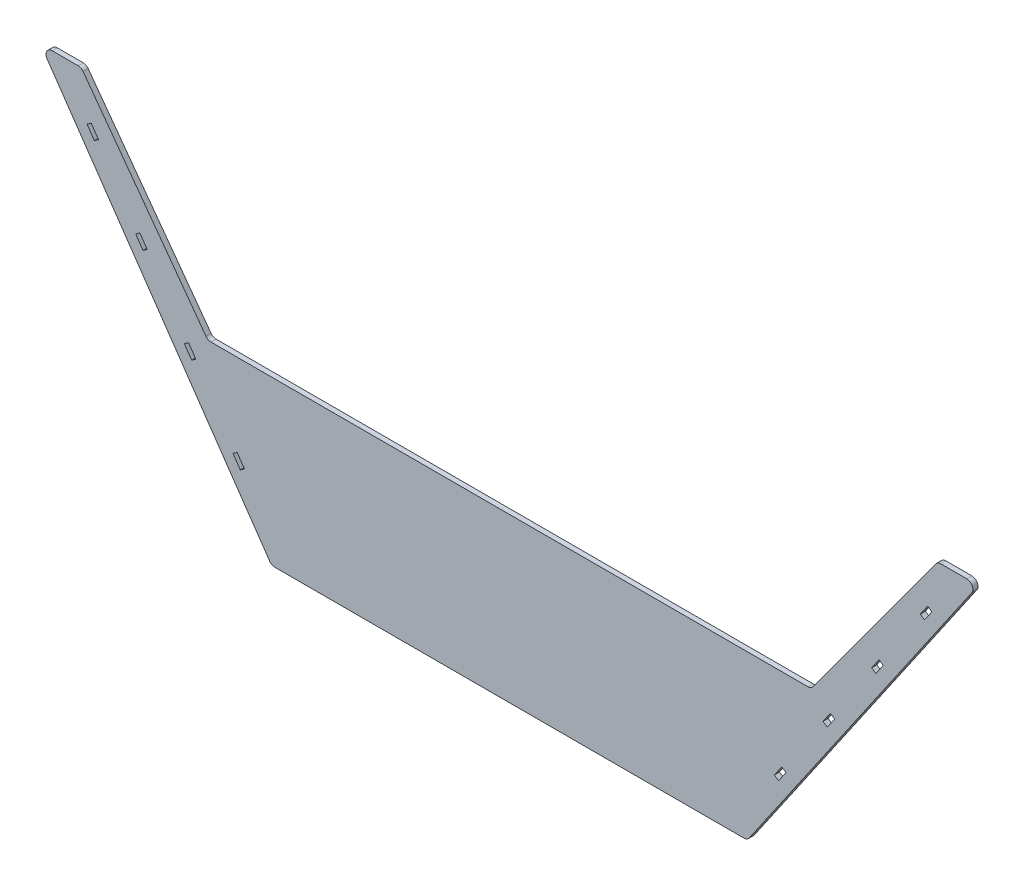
ISO-10303-21;
HEADER;
FILE_DESCRIPTION(('STEP AP214'),'2;1');
FILE_NAME('part.step','',(''),(''),'','','');
FILE_SCHEMA(('AUTOMOTIVE_DESIGN { 1 0 10303 214 1 1 1 1 }'));
ENDSEC;
DATA;
#1=APPLICATION_CONTEXT('core data for automotive mechanical design processes');
#2=APPLICATION_PROTOCOL_DEFINITION('international standard','automotive_design',2000,#1);
#3=PRODUCT_CONTEXT('',#1,'mechanical');
#4=PRODUCT('Part','Part','',(#3));
#5=PRODUCT_RELATED_PRODUCT_CATEGORY('part','',(#4));
#6=PRODUCT_DEFINITION_FORMATION('','',#4);
#7=PRODUCT_DEFINITION_CONTEXT('part definition',#1,'design');
#8=PRODUCT_DEFINITION('design','',#6,#7);
#9=PRODUCT_DEFINITION_SHAPE('','',#8);
#10=(LENGTH_UNIT() NAMED_UNIT(*) SI_UNIT(.MILLI.,.METRE.));
#11=(NAMED_UNIT(*) PLANE_ANGLE_UNIT() SI_UNIT($,.RADIAN.));
#12=(NAMED_UNIT(*) SI_UNIT($,.STERADIAN.) SOLID_ANGLE_UNIT());
#13=UNCERTAINTY_MEASURE_WITH_UNIT(LENGTH_MEASURE(1.E-05),#10,'distance_accuracy_value','');
#14=(GEOMETRIC_REPRESENTATION_CONTEXT(3) GLOBAL_UNCERTAINTY_ASSIGNED_CONTEXT((#13)) GLOBAL_UNIT_ASSIGNED_CONTEXT((#10,
#11,#12)) REPRESENTATION_CONTEXT('',''));
#15=CARTESIAN_POINT('',(0.,0.,0.));
#16=DIRECTION('',(0.,0.,1.));
#17=DIRECTION('',(1.,0.,0.));
#18=AXIS2_PLACEMENT_3D('',#15,#16,#17);
#19=CARTESIAN_POINT('',(0.,0.,2.5));
#20=DIRECTION('',(0.,0.,-1.));
#21=DIRECTION('',(-1.,0.,0.));
#22=AXIS2_PLACEMENT_3D('',#19,#20,#21);
#23=PLANE('',#22);
#24=DIRECTION('',(-0.823940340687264,0.566676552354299,0.));
#25=VECTOR('',#24,1.);
#26=CARTESIAN_POINT('',(-262.56575194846,142.692135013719,2.5));
#27=LINE('',#26,#25);
#28=CARTESIAN_POINT('',(-262.56575194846,142.692135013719,2.5));
#29=VERTEX_POINT('',#28);
#30=CARTESIAN_POINT('',(-264.625602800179,144.108826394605,2.5));
#31=VERTEX_POINT('',#30);
#32=EDGE_CURVE('E381',#29,#31,#27,.T.);
#33=ORIENTED_EDGE('',*,*,#32,.F.);
#34=DIRECTION('',(0.566676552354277,0.82394034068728,0.));
#35=VECTOR('',#34,1.);
#36=CARTESIAN_POINT('',(-262.56575194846,142.692135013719,2.5));
#37=LINE('',#36,#35);
#38=CARTESIAN_POINT('',(-266.147147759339,137.484832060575,2.5));
#39=VERTEX_POINT('',#38);
#40=EDGE_CURVE('E389',#39,#29,#37,.T.);
#41=ORIENTED_EDGE('',*,*,#40,.F.);
#42=DIRECTION('',(0.82394034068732,-0.566676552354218,0.));
#43=VECTOR('',#42,1.);
#44=CARTESIAN_POINT('',(-266.147147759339,137.484832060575,2.5));
#45=LINE('',#44,#43);
#46=CARTESIAN_POINT('',(-268.206998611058,138.901523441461,2.5));
#47=VERTEX_POINT('',#46);
#48=EDGE_CURVE('E386',#47,#39,#45,.T.);
#49=ORIENTED_EDGE('',*,*,#48,.F.);
#50=DIRECTION('',(-0.566676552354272,-0.823940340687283,0.));
#51=VECTOR('',#50,1.);
#52=CARTESIAN_POINT('',(-264.625602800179,144.108826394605,2.5));
#53=LINE('',#52,#51);
#54=EDGE_CURVE('E383',#31,#47,#53,.T.);
#55=ORIENTED_EDGE('',*,*,#54,.F.);
#56=EDGE_LOOP('',(#33,#41,#49,#55));
#57=FACE_BOUND('',#56,.T.);
#58=DIRECTION('',(-0.823940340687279,-0.566676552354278,0.));
#59=VECTOR('',#58,1.);
#60=CARTESIAN_POINT('',(-581.458845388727,73.3163583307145,2.5));
#61=LINE('',#60,#59);
#62=CARTESIAN_POINT('',(-579.398994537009,74.7330497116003,2.5));
#63=VERTEX_POINT('',#62);
#64=CARTESIAN_POINT('',(-581.458845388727,73.3163583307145,2.5));
#65=VERTEX_POINT('',#64);
#66=EDGE_CURVE('E443',#63,#65,#61,.T.);
#67=ORIENTED_EDGE('',*,*,#66,.F.);
#68=DIRECTION('',(-0.566676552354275,0.823940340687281,0.));
#69=VECTOR('',#68,1.);
#70=CARTESIAN_POINT('',(-579.398994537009,74.7330497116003,2.5));
#71=LINE('',#70,#69);
#72=CARTESIAN_POINT('',(-575.81759872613,69.5257467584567,2.5));
#73=VERTEX_POINT('',#72);
#74=EDGE_CURVE('E451',#73,#63,#71,.T.);
#75=ORIENTED_EDGE('',*,*,#74,.F.);
#76=DIRECTION('',(0.82394034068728,0.566676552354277,0.));
#77=VECTOR('',#76,1.);
#78=CARTESIAN_POINT('',(-577.877449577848,68.109055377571,2.5));
#79=LINE('',#78,#77);
#80=CARTESIAN_POINT('',(-577.877449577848,68.109055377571,2.5));
#81=VERTEX_POINT('',#80);
#82=EDGE_CURVE('E448',#81,#73,#79,.T.);
#83=ORIENTED_EDGE('',*,*,#82,.F.);
#84=DIRECTION('',(0.566676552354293,-0.823940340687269,0.));
#85=VECTOR('',#84,1.);
#86=CARTESIAN_POINT('',(-581.458845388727,73.3163583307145,2.5));
#87=LINE('',#86,#85);
#88=EDGE_CURVE('E445',#65,#81,#87,.T.);
#89=ORIENTED_EDGE('',*,*,#88,.F.);
#90=EDGE_LOOP('',(#67,#75,#83,#89));
#91=FACE_BOUND('',#90,.T.);
#92=DIRECTION('',(-0.823940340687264,-0.566676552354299,0.));
#93=VECTOR('',#92,1.);
#94=CARTESIAN_POINT('',(-629.173011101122,142.692135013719,2.5));
#95=LINE('',#94,#93);
#96=CARTESIAN_POINT('',(-627.113160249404,144.108826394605,2.5));
#97=VERTEX_POINT('',#96);
#98=CARTESIAN_POINT('',(-629.173011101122,142.692135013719,2.5));
#99=VERTEX_POINT('',#98);
#100=EDGE_CURVE('E505',#97,#99,#95,.T.);
#101=ORIENTED_EDGE('',*,*,#100,.F.);
#102=DIRECTION('',(-0.566676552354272,0.823940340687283,0.));
#103=VECTOR('',#102,1.);
#104=CARTESIAN_POINT('',(-627.113160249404,144.108826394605,2.5));
#105=LINE('',#104,#103);
#106=CARTESIAN_POINT('',(-623.531764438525,138.901523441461,2.5));
#107=VERTEX_POINT('',#106);
#108=EDGE_CURVE('E513',#107,#97,#105,.T.);
#109=ORIENTED_EDGE('',*,*,#108,.F.);
#110=DIRECTION('',(0.82394034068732,0.566676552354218,0.));
#111=VECTOR('',#110,1.);
#112=CARTESIAN_POINT('',(-625.591615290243,137.484832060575,2.5));
#113=LINE('',#112,#111);
#114=CARTESIAN_POINT('',(-625.591615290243,137.484832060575,2.5));
#115=VERTEX_POINT('',#114);
#116=EDGE_CURVE('E510',#115,#107,#113,.T.);
#117=ORIENTED_EDGE('',*,*,#116,.F.);
#118=DIRECTION('',(0.566676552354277,-0.82394034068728,0.));
#119=VECTOR('',#118,1.);
#120=CARTESIAN_POINT('',(-629.173011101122,142.692135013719,2.5));
#121=LINE('',#120,#119);
#122=EDGE_CURVE('E507',#99,#115,#121,.T.);
#123=ORIENTED_EDGE('',*,*,#122,.F.);
#124=EDGE_LOOP('',(#101,#109,#117,#123));
#125=FACE_BOUND('',#124,.T.);
#126=DIRECTION('',(-0.823940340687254,0.566676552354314,0.));
#127=VECTOR('',#126,1.);
#128=CARTESIAN_POINT('',(-310.279917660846,73.3163583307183,2.5));
#129=LINE('',#128,#127);
#130=CARTESIAN_POINT('',(-310.279917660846,73.3163583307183,2.5));
#131=VERTEX_POINT('',#130);
#132=CARTESIAN_POINT('',(-312.339768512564,74.7330497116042,2.5));
#133=VERTEX_POINT('',#132);
#134=EDGE_CURVE('E567',#131,#133,#129,.T.);
#135=ORIENTED_EDGE('',*,*,#134,.F.);
#136=DIRECTION('',(0.566676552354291,0.82394034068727,0.));
#137=VECTOR('',#136,1.);
#138=CARTESIAN_POINT('',(-310.279917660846,73.3163583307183,2.5));
#139=LINE('',#138,#137);
#140=CARTESIAN_POINT('',(-313.861313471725,68.1090553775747,2.5));
#141=VERTEX_POINT('',#140);
#142=EDGE_CURVE('E575',#141,#131,#139,.T.);
#143=ORIENTED_EDGE('',*,*,#142,.F.);
#144=DIRECTION('',(0.823940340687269,-0.566676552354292,0.));
#145=VECTOR('',#144,1.);
#146=CARTESIAN_POINT('',(-313.861313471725,68.1090553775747,2.5));
#147=LINE('',#146,#145);
#148=CARTESIAN_POINT('',(-315.921164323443,69.5257467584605,2.5));
#149=VERTEX_POINT('',#148);
#150=EDGE_CURVE('E572',#149,#141,#147,.T.);
#151=ORIENTED_EDGE('',*,*,#150,.F.);
#152=DIRECTION('',(-0.566676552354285,-0.823940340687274,0.));
#153=VECTOR('',#152,1.);
#154=CARTESIAN_POINT('',(-312.339768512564,74.7330497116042,2.5));
#155=LINE('',#154,#153);
#156=EDGE_CURVE('E569',#133,#149,#155,.T.);
#157=ORIENTED_EDGE('',*,*,#156,.F.);
#158=EDGE_LOOP('',(#135,#143,#151,#157));
#159=FACE_BOUND('',#158,.T.);
#160=DIRECTION('',(1.,0.,0.));
#161=VECTOR('',#160,1.);
#162=CARTESIAN_POINT('',(-562.534071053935,35.2119318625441,2.5));
#163=LINE('',#162,#161);
#164=CARTESIAN_POINT('',(-560.956322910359,35.2119318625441,2.5));
#165=VERTEX_POINT('',#164);
#166=CARTESIAN_POINT('',(-330.782440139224,35.2119318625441,2.5));
#167=VERTEX_POINT('',#166);
#168=EDGE_CURVE('E618',#165,#167,#163,.T.);
#169=ORIENTED_EDGE('',*,*,#168,.T.);
#170=CARTESIAN_POINT('',(-330.782440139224,38.2119318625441,2.5));
#171=DIRECTION('',(0.,0.,-1.));
#172=DIRECTION('',(-1.,0.,0.));
#173=AXIS2_PLACEMENT_3D('',#170,#171,#172);
#174=CIRCLE('',#173,3.);
#175=CARTESIAN_POINT('',(-328.310619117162,36.5119022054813,2.5));
#176=VERTEX_POINT('',#175);
#177=EDGE_CURVE('E673',#167,#176,#174,.F.);
#178=ORIENTED_EDGE('',*,*,#177,.T.);
#179=DIRECTION('',(0.566676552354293,0.823940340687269,0.));
#180=VECTOR('',#179,1.);
#181=CARTESIAN_POINT('',(-329.204691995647,35.2119318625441,2.5));
#182=LINE('',#181,#180);
#183=CARTESIAN_POINT('',(-219.101892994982,195.299970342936,2.5));
#184=VERTEX_POINT('',#183);
#185=EDGE_CURVE('E598',#176,#184,#182,.T.);
#186=ORIENTED_EDGE('',*,*,#185,.T.);
#187=CARTESIAN_POINT('',(-221.573714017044,196.999999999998,2.5));
#188=DIRECTION('',(0.,0.,-1.));
#189=DIRECTION('',(-1.,0.,0.));
#190=AXIS2_PLACEMENT_3D('',#187,#188,#189);
#191=CIRCLE('',#190,3.);
#192=CARTESIAN_POINT('',(-221.573714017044,199.999999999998,2.5));
#193=VERTEX_POINT('',#192);
#194=EDGE_CURVE('E669',#184,#193,#191,.F.);
#195=ORIENTED_EDGE('',*,*,#194,.T.);
#196=DIRECTION('',(-1.,0.,0.));
#197=VECTOR('',#196,1.);
#198=CARTESIAN_POINT('',(-235.869381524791,200.,2.5));
#199=LINE('',#198,#197);
#200=CARTESIAN_POINT('',(-234.347824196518,200.,2.5));
#201=VERTEX_POINT('',#200);
#202=EDGE_CURVE('E601',#193,#201,#199,.T.);
#203=ORIENTED_EDGE('',*,*,#202,.T.);
#204=CARTESIAN_POINT('',(-234.347824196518,197.,2.5));
#205=DIRECTION('',(0.,0.,-1.));
#206=DIRECTION('',(-1.,0.,0.));
#207=AXIS2_PLACEMENT_3D('',#204,#205,#206);
#208=CIRCLE('',#207,3.);
#209=CARTESIAN_POINT('',(-236.768301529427,198.772368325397,2.5));
#210=VERTEX_POINT('',#209);
#211=EDGE_CURVE('E667',#201,#210,#208,.F.);
#212=ORIENTED_EDGE('',*,*,#211,.T.);
#213=DIRECTION('',(-0.590789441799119,-0.806825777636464,0.));
#214=VECTOR('',#213,1.);
#215=CARTESIAN_POINT('',(-235.869381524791,200.,2.5));
#216=LINE('',#215,#214);
#217=CARTESIAN_POINT('',(-297.055606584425,116.439563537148,2.5));
#218=VERTEX_POINT('',#217);
#219=EDGE_CURVE('E605',#210,#218,#216,.T.);
#220=ORIENTED_EDGE('',*,*,#219,.T.);
#221=CARTESIAN_POINT('',(-299.476083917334,118.211931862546,2.5));
#222=DIRECTION('',(0.,0.,-1.));
#223=DIRECTION('',(-1.,0.,0.));
#224=AXIS2_PLACEMENT_3D('',#221,#222,#223);
#225=CIRCLE('',#224,3.);
#226=CARTESIAN_POINT('',(-299.476083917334,115.211931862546,2.5));
#227=VERTEX_POINT('',#226);
#228=EDGE_CURVE('E706',#218,#227,#225,.T.);
#229=ORIENTED_EDGE('',*,*,#228,.T.);
#230=DIRECTION('',(-1.,0.,0.));
#231=VECTOR('',#230,1.);
#232=CARTESIAN_POINT('',(-593.784236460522,115.211931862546,2.5));
#233=LINE('',#232,#231);
#234=CARTESIAN_POINT('',(-592.262679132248,115.211931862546,2.5));
#235=VERTEX_POINT('',#234);
#236=EDGE_CURVE('E608',#227,#235,#233,.T.);
#237=ORIENTED_EDGE('',*,*,#236,.T.);
#238=CARTESIAN_POINT('',(-592.262679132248,118.211931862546,2.5));
#239=DIRECTION('',(0.,0.,-1.));
#240=DIRECTION('',(-1.,0.,0.));
#241=AXIS2_PLACEMENT_3D('',#238,#239,#240);
#242=CIRCLE('',#241,3.);
#243=CARTESIAN_POINT('',(-594.683156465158,116.439563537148,2.5));
#244=VERTEX_POINT('',#243);
#245=EDGE_CURVE('E11',#235,#244,#242,.T.);
#246=ORIENTED_EDGE('',*,*,#245,.T.);
#247=DIRECTION('',(-0.590789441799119,0.806825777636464,0.));
#248=VECTOR('',#247,1.);
#249=CARTESIAN_POINT('',(-655.869381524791,200.,2.5));
#250=LINE('',#249,#248);
#251=CARTESIAN_POINT('',(-654.970461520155,198.772368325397,2.5));
#252=VERTEX_POINT('',#251);
#253=EDGE_CURVE('E611',#244,#252,#250,.T.);
#254=ORIENTED_EDGE('',*,*,#253,.T.);
#255=CARTESIAN_POINT('',(-657.390938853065,197.,2.5));
#256=DIRECTION('',(0.,0.,-1.));
#257=DIRECTION('',(-1.,0.,0.));
#258=AXIS2_PLACEMENT_3D('',#255,#256,#257);
#259=CIRCLE('',#258,3.);
#260=CARTESIAN_POINT('',(-657.390938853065,200.,2.5));
#261=VERTEX_POINT('',#260);
#262=EDGE_CURVE('E664',#252,#261,#259,.F.);
#263=ORIENTED_EDGE('',*,*,#262,.T.);
#264=DIRECTION('',(-1.,0.,0.));
#265=VECTOR('',#264,1.);
#266=CARTESIAN_POINT('',(-675.869381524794,199.999999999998,2.5));
#267=LINE('',#266,#265);
#268=CARTESIAN_POINT('',(-670.165049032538,199.999999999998,2.5));
#269=VERTEX_POINT('',#268);
#270=EDGE_CURVE('E614',#261,#269,#267,.T.);
#271=ORIENTED_EDGE('',*,*,#270,.T.);
#272=CARTESIAN_POINT('',(-670.165049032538,196.999999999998,2.5));
#273=DIRECTION('',(0.,0.,-1.));
#274=DIRECTION('',(-1.,0.,0.));
#275=AXIS2_PLACEMENT_3D('',#272,#273,#274);
#276=CIRCLE('',#275,3.);
#277=CARTESIAN_POINT('',(-672.6368700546,195.299970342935,2.5));
#278=VERTEX_POINT('',#277);
#279=EDGE_CURVE('E55',#269,#278,#276,.F.);
#280=ORIENTED_EDGE('',*,*,#279,.T.);
#281=DIRECTION('',(0.566676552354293,-0.823940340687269,0.));
#282=VECTOR('',#281,1.);
#283=CARTESIAN_POINT('',(-562.534071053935,35.2119318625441,2.5));
#284=LINE('',#283,#282);
#285=CARTESIAN_POINT('',(-563.428143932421,36.5119022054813,2.5));
#286=VERTEX_POINT('',#285);
#287=EDGE_CURVE('E616',#278,#286,#284,.T.);
#288=ORIENTED_EDGE('',*,*,#287,.T.);
#289=CARTESIAN_POINT('',(-560.956322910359,38.2119318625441,2.5));
#290=DIRECTION('',(0.,0.,-1.));
#291=DIRECTION('',(-1.,0.,0.));
#292=AXIS2_PLACEMENT_3D('',#289,#290,#291);
#293=CIRCLE('',#292,3.);
#294=EDGE_CURVE('E671',#286,#165,#293,.F.);
#295=ORIENTED_EDGE('',*,*,#294,.T.);
#296=EDGE_LOOP('',(#169,#178,#186,#195,#203,#212,#220,#229,#237,#246,#254,#263,#271,#280,#288,#295));
#297=FACE_BOUND('',#296,.T.);
#298=DIRECTION('',(-0.823940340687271,-0.56667655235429,0.));
#299=VECTOR('',#298,1.);
#300=CARTESIAN_POINT('',(-653.030093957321,177.380023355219,2.5));
#301=LINE('',#300,#299);
#302=CARTESIAN_POINT('',(-650.970243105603,178.796714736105,2.5));
#303=VERTEX_POINT('',#302);
#304=CARTESIAN_POINT('',(-653.030093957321,177.380023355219,2.5));
#305=VERTEX_POINT('',#304);
#306=EDGE_CURVE('E536',#303,#305,#301,.T.);
#307=ORIENTED_EDGE('',*,*,#306,.F.);
#308=DIRECTION('',(-0.566676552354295,0.823940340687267,0.));
#309=VECTOR('',#308,1.);
#310=CARTESIAN_POINT('',(-650.970243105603,178.796714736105,2.5));
#311=LINE('',#310,#309);
#312=CARTESIAN_POINT('',(-647.388847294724,173.589411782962,2.5));
#313=VERTEX_POINT('',#312);
#314=EDGE_CURVE('E544',#313,#303,#311,.T.);
#315=ORIENTED_EDGE('',*,*,#314,.F.);
#316=DIRECTION('',(0.823940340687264,0.566676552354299,0.));
#317=VECTOR('',#316,1.);
#318=CARTESIAN_POINT('',(-649.448698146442,172.172720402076,2.5));
#319=LINE('',#318,#317);
#320=CARTESIAN_POINT('',(-649.448698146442,172.172720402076,2.5));
#321=VERTEX_POINT('',#320);
#322=EDGE_CURVE('E541',#321,#313,#319,.T.);
#323=ORIENTED_EDGE('',*,*,#322,.F.);
#324=DIRECTION('',(0.566676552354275,-0.823940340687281,0.));
#325=VECTOR('',#324,1.);
#326=CARTESIAN_POINT('',(-653.030093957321,177.380023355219,2.5));
#327=LINE('',#326,#325);
#328=EDGE_CURVE('E538',#305,#321,#327,.T.);
#329=ORIENTED_EDGE('',*,*,#328,.F.);
#330=EDGE_LOOP('',(#307,#315,#323,#329));
#331=FACE_BOUND('',#330,.T.);
#332=DIRECTION('',(-0.823940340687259,-0.566676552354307,0.));
#333=VECTOR('',#332,1.);
#334=CARTESIAN_POINT('',(-605.315928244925,108.004246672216,2.5));
#335=LINE('',#334,#333);
#336=CARTESIAN_POINT('',(-603.256077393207,109.420938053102,2.5));
#337=VERTEX_POINT('',#336);
#338=CARTESIAN_POINT('',(-605.315928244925,108.004246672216,2.5));
#339=VERTEX_POINT('',#338);
#340=EDGE_CURVE('E474',#337,#339,#335,.T.);
#341=ORIENTED_EDGE('',*,*,#340,.F.);
#342=DIRECTION('',(-0.566676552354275,0.823940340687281,0.));
#343=VECTOR('',#342,1.);
#344=CARTESIAN_POINT('',(-603.256077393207,109.420938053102,2.5));
#345=LINE('',#344,#343);
#346=CARTESIAN_POINT('',(-599.674681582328,104.213635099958,2.5));
#347=VERTEX_POINT('',#346);
#348=EDGE_CURVE('E482',#347,#337,#345,.T.);
#349=ORIENTED_EDGE('',*,*,#348,.F.);
#350=DIRECTION('',(0.823940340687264,0.566676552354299,0.));
#351=VECTOR('',#350,1.);
#352=CARTESIAN_POINT('',(-601.734532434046,102.796943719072,2.5));
#353=LINE('',#352,#351);
#354=CARTESIAN_POINT('',(-601.734532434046,102.796943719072,2.5));
#355=VERTEX_POINT('',#354);
#356=EDGE_CURVE('E479',#355,#347,#353,.T.);
#357=ORIENTED_EDGE('',*,*,#356,.F.);
#358=DIRECTION('',(0.566676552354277,-0.82394034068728,0.));
#359=VECTOR('',#358,1.);
#360=CARTESIAN_POINT('',(-605.315928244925,108.004246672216,2.5));
#361=LINE('',#360,#359);
#362=EDGE_CURVE('E476',#339,#355,#361,.T.);
#363=ORIENTED_EDGE('',*,*,#362,.F.);
#364=EDGE_LOOP('',(#341,#349,#357,#363));
#365=FACE_BOUND('',#364,.T.);
#366=DIRECTION('',(-0.823940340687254,0.566676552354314,0.));
#367=VECTOR('',#366,1.);
#368=CARTESIAN_POINT('',(-286.42283480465,108.004246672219,2.5));
#369=LINE('',#368,#367);
#370=CARTESIAN_POINT('',(-286.42283480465,108.004246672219,2.5));
#371=VERTEX_POINT('',#370);
#372=CARTESIAN_POINT('',(-288.482685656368,109.420938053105,2.5));
#373=VERTEX_POINT('',#372);
#374=EDGE_CURVE('E412',#371,#373,#369,.T.);
#375=ORIENTED_EDGE('',*,*,#374,.F.);
#376=DIRECTION('',(0.566676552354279,0.823940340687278,0.));
#377=VECTOR('',#376,1.);
#378=CARTESIAN_POINT('',(-286.42283480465,108.004246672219,2.5));
#379=LINE('',#378,#377);
#380=CARTESIAN_POINT('',(-290.004230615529,102.796943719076,2.5));
#381=VERTEX_POINT('',#380);
#382=EDGE_CURVE('E420',#381,#371,#379,.T.);
#383=ORIENTED_EDGE('',*,*,#382,.F.);
#384=DIRECTION('',(0.823940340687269,-0.566676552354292,0.));
#385=VECTOR('',#384,1.);
#386=CARTESIAN_POINT('',(-290.004230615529,102.796943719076,2.5));
#387=LINE('',#386,#385);
#388=CARTESIAN_POINT('',(-292.064081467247,104.213635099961,2.5));
#389=VERTEX_POINT('',#388);
#390=EDGE_CURVE('E417',#389,#381,#387,.T.);
#391=ORIENTED_EDGE('',*,*,#390,.F.);
#392=DIRECTION('',(-0.566676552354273,-0.823940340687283,0.));
#393=VECTOR('',#392,1.);
#394=CARTESIAN_POINT('',(-288.482685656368,109.420938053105,2.5));
#395=LINE('',#394,#393);
#396=EDGE_CURVE('E414',#373,#389,#395,.T.);
#397=ORIENTED_EDGE('',*,*,#396,.F.);
#398=EDGE_LOOP('',(#375,#383,#391,#397));
#399=FACE_BOUND('',#398,.T.);
#400=DIRECTION('',(-0.823940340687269,0.566676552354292,0.));
#401=VECTOR('',#400,1.);
#402=CARTESIAN_POINT('',(-238.708669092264,177.380023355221,2.5));
#403=LINE('',#402,#401);
#404=CARTESIAN_POINT('',(-238.708669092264,177.380023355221,2.5));
#405=VERTEX_POINT('',#404);
#406=CARTESIAN_POINT('',(-240.768519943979,178.796714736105,2.5));
#407=VERTEX_POINT('',#406);
#408=EDGE_CURVE('E340',#405,#407,#403,.T.);
#409=ORIENTED_EDGE('',*,*,#408,.F.);
#410=DIRECTION('',(0.566676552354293,0.823940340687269,0.));
#411=VECTOR('',#410,1.);
#412=CARTESIAN_POINT('',(-238.708669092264,177.380023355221,2.5));
#413=LINE('',#412,#411);
#414=CARTESIAN_POINT('',(-242.290064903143,172.172720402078,2.5));
#415=VERTEX_POINT('',#414);
#416=EDGE_CURVE('E365',#415,#405,#413,.T.);
#417=ORIENTED_EDGE('',*,*,#416,.F.);
#418=DIRECTION('',(0.823940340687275,-0.566676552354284,0.));
#419=VECTOR('',#418,1.);
#420=CARTESIAN_POINT('',(-242.290064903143,172.172720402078,2.5));
#421=LINE('',#420,#419);
#422=CARTESIAN_POINT('',(-244.349915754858,173.589411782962,2.5));
#423=VERTEX_POINT('',#422);
#424=EDGE_CURVE('E363',#423,#415,#421,.T.);
#425=ORIENTED_EDGE('',*,*,#424,.F.);
#426=DIRECTION('',(-0.566676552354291,-0.82394034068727,0.));
#427=VECTOR('',#426,1.);
#428=CARTESIAN_POINT('',(-240.768519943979,178.796714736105,2.5));
#429=LINE('',#428,#427);
#430=EDGE_CURVE('E350',#407,#423,#429,.T.);
#431=ORIENTED_EDGE('',*,*,#430,.F.);
#432=EDGE_LOOP('',(#409,#417,#425,#431));
#433=FACE_BOUND('',#432,.T.);
#434=ADVANCED_FACE('F33',(#57,#91,#125,#159,#297,#331,#365,#399,#433),#23,.F.);
#435=CARTESIAN_POINT('',(0.,0.,0.));
#436=DIRECTION('',(0.,0.,-1.));
#437=DIRECTION('',(-1.,0.,0.));
#438=AXIS2_PLACEMENT_3D('',#435,#436,#437);
#439=PLANE('',#438);
#440=DIRECTION('',(0.566676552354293,0.823940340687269,0.));
#441=VECTOR('',#440,1.);
#442=CARTESIAN_POINT('',(-329.204691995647,35.2119318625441,0.));
#443=LINE('',#442,#441);
#444=CARTESIAN_POINT('',(-328.310619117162,36.5119022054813,0.));
#445=VERTEX_POINT('',#444);
#446=CARTESIAN_POINT('',(-219.101892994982,195.299970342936,0.));
#447=VERTEX_POINT('',#446);
#448=EDGE_CURVE('E597',#445,#447,#443,.T.);
#449=ORIENTED_EDGE('',*,*,#448,.F.);
#450=CARTESIAN_POINT('',(-330.782440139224,38.2119318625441,0.));
#451=DIRECTION('',(0.,0.,-1.));
#452=DIRECTION('',(-1.,0.,0.));
#453=AXIS2_PLACEMENT_3D('',#450,#451,#452);
#454=CIRCLE('',#453,3.);
#455=CARTESIAN_POINT('',(-330.782440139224,35.2119318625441,0.));
#456=VERTEX_POINT('',#455);
#457=EDGE_CURVE('E657',#445,#456,#454,.T.);
#458=ORIENTED_EDGE('',*,*,#457,.T.);
#459=DIRECTION('',(1.,0.,0.));
#460=VECTOR('',#459,1.);
#461=CARTESIAN_POINT('',(-562.534071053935,35.2119318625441,0.));
#462=LINE('',#461,#460);
#463=CARTESIAN_POINT('',(-560.956322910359,35.2119318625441,0.));
#464=VERTEX_POINT('',#463);
#465=EDGE_CURVE('E602',#464,#456,#462,.T.);
#466=ORIENTED_EDGE('',*,*,#465,.F.);
#467=CARTESIAN_POINT('',(-560.956322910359,38.2119318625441,0.));
#468=DIRECTION('',(0.,0.,-1.));
#469=DIRECTION('',(-1.,0.,0.));
#470=AXIS2_PLACEMENT_3D('',#467,#468,#469);
#471=CIRCLE('',#470,3.);
#472=CARTESIAN_POINT('',(-563.428143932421,36.5119022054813,0.));
#473=VERTEX_POINT('',#472);
#474=EDGE_CURVE('E655',#464,#473,#471,.T.);
#475=ORIENTED_EDGE('',*,*,#474,.T.);
#476=DIRECTION('',(0.566676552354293,-0.823940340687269,0.));
#477=VECTOR('',#476,1.);
#478=CARTESIAN_POINT('',(-562.534071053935,35.2119318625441,0.));
#479=LINE('',#478,#477);
#480=CARTESIAN_POINT('',(-672.6368700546,195.299970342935,0.));
#481=VERTEX_POINT('',#480);
#482=EDGE_CURVE('E639',#481,#473,#479,.T.);
#483=ORIENTED_EDGE('',*,*,#482,.F.);
#484=CARTESIAN_POINT('',(-670.165049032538,196.999999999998,0.));
#485=DIRECTION('',(0.,0.,-1.));
#486=DIRECTION('',(-1.,0.,0.));
#487=AXIS2_PLACEMENT_3D('',#484,#485,#486);
#488=CIRCLE('',#487,3.);
#489=CARTESIAN_POINT('',(-670.165049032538,199.999999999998,0.));
#490=VERTEX_POINT('',#489);
#491=EDGE_CURVE('E649',#481,#490,#488,.T.);
#492=ORIENTED_EDGE('',*,*,#491,.T.);
#493=DIRECTION('',(-1.,0.,0.));
#494=VECTOR('',#493,1.);
#495=CARTESIAN_POINT('',(-675.869381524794,199.999999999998,0.));
#496=LINE('',#495,#494);
#497=CARTESIAN_POINT('',(-657.390938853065,200.,0.));
#498=VERTEX_POINT('',#497);
#499=EDGE_CURVE('E636',#498,#490,#496,.T.);
#500=ORIENTED_EDGE('',*,*,#499,.F.);
#501=CARTESIAN_POINT('',(-657.390938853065,197.,0.));
#502=DIRECTION('',(0.,0.,-1.));
#503=DIRECTION('',(-1.,0.,0.));
#504=AXIS2_PLACEMENT_3D('',#501,#502,#503);
#505=CIRCLE('',#504,3.);
#506=CARTESIAN_POINT('',(-654.970461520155,198.772368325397,0.));
#507=VERTEX_POINT('',#506);
#508=EDGE_CURVE('E647',#498,#507,#505,.T.);
#509=ORIENTED_EDGE('',*,*,#508,.T.);
#510=DIRECTION('',(-0.590789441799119,0.806825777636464,0.));
#511=VECTOR('',#510,1.);
#512=CARTESIAN_POINT('',(-655.869381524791,200.,0.));
#513=LINE('',#512,#511);
#514=CARTESIAN_POINT('',(-594.683156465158,116.439563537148,0.));
#515=VERTEX_POINT('',#514);
#516=EDGE_CURVE('E633',#515,#507,#513,.T.);
#517=ORIENTED_EDGE('',*,*,#516,.F.);
#518=CARTESIAN_POINT('',(-592.262679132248,118.211931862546,0.));
#519=DIRECTION('',(0.,0.,-1.));
#520=DIRECTION('',(-1.,0.,0.));
#521=AXIS2_PLACEMENT_3D('',#518,#519,#520);
#522=CIRCLE('',#521,3.);
#523=CARTESIAN_POINT('',(-592.262679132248,115.211931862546,0.));
#524=VERTEX_POINT('',#523);
#525=EDGE_CURVE('E41',#515,#524,#522,.F.);
#526=ORIENTED_EDGE('',*,*,#525,.T.);
#527=DIRECTION('',(-1.,0.,0.));
#528=VECTOR('',#527,1.);
#529=CARTESIAN_POINT('',(-593.784236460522,115.211931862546,0.));
#530=LINE('',#529,#528);
#531=CARTESIAN_POINT('',(-299.476083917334,115.211931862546,0.));
#532=VERTEX_POINT('',#531);
#533=EDGE_CURVE('E630',#532,#524,#530,.T.);
#534=ORIENTED_EDGE('',*,*,#533,.F.);
#535=CARTESIAN_POINT('',(-299.476083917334,118.211931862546,0.));
#536=DIRECTION('',(0.,0.,-1.));
#537=DIRECTION('',(-1.,0.,0.));
#538=AXIS2_PLACEMENT_3D('',#535,#536,#537);
#539=CIRCLE('',#538,3.);
#540=CARTESIAN_POINT('',(-297.055606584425,116.439563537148,0.));
#541=VERTEX_POINT('',#540);
#542=EDGE_CURVE('E704',#532,#541,#539,.F.);
#543=ORIENTED_EDGE('',*,*,#542,.T.);
#544=DIRECTION('',(-0.590789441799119,-0.806825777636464,0.));
#545=VECTOR('',#544,1.);
#546=CARTESIAN_POINT('',(-235.869381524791,200.,0.));
#547=LINE('',#546,#545);
#548=CARTESIAN_POINT('',(-236.768301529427,198.772368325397,0.));
#549=VERTEX_POINT('',#548);
#550=EDGE_CURVE('E627',#549,#541,#547,.T.);
#551=ORIENTED_EDGE('',*,*,#550,.F.);
#552=CARTESIAN_POINT('',(-234.347824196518,197.,0.));
#553=DIRECTION('',(0.,0.,-1.));
#554=DIRECTION('',(-1.,0.,0.));
#555=AXIS2_PLACEMENT_3D('',#552,#553,#554);
#556=CIRCLE('',#555,3.);
#557=CARTESIAN_POINT('',(-234.347824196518,200.,0.));
#558=VERTEX_POINT('',#557);
#559=EDGE_CURVE('E651',#549,#558,#556,.T.);
#560=ORIENTED_EDGE('',*,*,#559,.T.);
#561=DIRECTION('',(-1.,0.,0.));
#562=VECTOR('',#561,1.);
#563=CARTESIAN_POINT('',(-235.869381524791,200.,0.));
#564=LINE('',#563,#562);
#565=CARTESIAN_POINT('',(-221.573714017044,199.999999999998,0.));
#566=VERTEX_POINT('',#565);
#567=EDGE_CURVE('E624',#566,#558,#564,.T.);
#568=ORIENTED_EDGE('',*,*,#567,.F.);
#569=CARTESIAN_POINT('',(-221.573714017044,196.999999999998,0.));
#570=DIRECTION('',(0.,0.,-1.));
#571=DIRECTION('',(-1.,0.,0.));
#572=AXIS2_PLACEMENT_3D('',#569,#570,#571);
#573=CIRCLE('',#572,3.);
#574=EDGE_CURVE('E653',#566,#447,#573,.T.);
#575=ORIENTED_EDGE('',*,*,#574,.T.);
#576=EDGE_LOOP('',(#449,#458,#466,#475,#483,#492,#500,#509,#517,#526,#534,#543,#551,#560,#568,#575));
#577=FACE_BOUND('',#576,.T.);
#578=DIRECTION('',(0.566676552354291,0.82394034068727,0.));
#579=VECTOR('',#578,1.);
#580=CARTESIAN_POINT('',(-310.279917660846,73.3163583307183,0.));
#581=LINE('',#580,#579);
#582=CARTESIAN_POINT('',(-313.861313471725,68.1090553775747,0.));
#583=VERTEX_POINT('',#582);
#584=CARTESIAN_POINT('',(-310.279917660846,73.3163583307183,0.));
#585=VERTEX_POINT('',#584);
#586=EDGE_CURVE('E570',#583,#585,#581,.T.);
#587=ORIENTED_EDGE('',*,*,#586,.T.);
#588=DIRECTION('',(-0.823940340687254,0.566676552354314,0.));
#589=VECTOR('',#588,1.);
#590=CARTESIAN_POINT('',(-310.279917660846,73.3163583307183,0.));
#591=LINE('',#590,#589);
#592=CARTESIAN_POINT('',(-312.339768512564,74.7330497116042,0.));
#593=VERTEX_POINT('',#592);
#594=EDGE_CURVE('E566',#585,#593,#591,.T.);
#595=ORIENTED_EDGE('',*,*,#594,.T.);
#596=DIRECTION('',(-0.566676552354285,-0.823940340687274,0.));
#597=VECTOR('',#596,1.);
#598=CARTESIAN_POINT('',(-312.339768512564,74.7330497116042,0.));
#599=LINE('',#598,#597);
#600=CARTESIAN_POINT('',(-315.921164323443,69.5257467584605,0.));
#601=VERTEX_POINT('',#600);
#602=EDGE_CURVE('E580',#593,#601,#599,.T.);
#603=ORIENTED_EDGE('',*,*,#602,.T.);
#604=DIRECTION('',(0.823940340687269,-0.566676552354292,0.));
#605=VECTOR('',#604,1.);
#606=CARTESIAN_POINT('',(-313.861313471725,68.1090553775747,0.));
#607=LINE('',#606,#605);
#608=EDGE_CURVE('E583',#601,#583,#607,.T.);
#609=ORIENTED_EDGE('',*,*,#608,.T.);
#610=EDGE_LOOP('',(#587,#595,#603,#609));
#611=FACE_BOUND('',#610,.T.);
#612=DIRECTION('',(-0.566676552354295,0.823940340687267,0.));
#613=VECTOR('',#612,1.);
#614=CARTESIAN_POINT('',(-650.970243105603,178.796714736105,0.));
#615=LINE('',#614,#613);
#616=CARTESIAN_POINT('',(-647.388847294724,173.589411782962,0.));
#617=VERTEX_POINT('',#616);
#618=CARTESIAN_POINT('',(-650.970243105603,178.796714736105,0.));
#619=VERTEX_POINT('',#618);
#620=EDGE_CURVE('E539',#617,#619,#615,.T.);
#621=ORIENTED_EDGE('',*,*,#620,.T.);
#622=DIRECTION('',(-0.823940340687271,-0.56667655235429,0.));
#623=VECTOR('',#622,1.);
#624=CARTESIAN_POINT('',(-653.030093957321,177.380023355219,0.));
#625=LINE('',#624,#623);
#626=CARTESIAN_POINT('',(-653.030093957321,177.380023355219,0.));
#627=VERTEX_POINT('',#626);
#628=EDGE_CURVE('E535',#619,#627,#625,.T.);
#629=ORIENTED_EDGE('',*,*,#628,.T.);
#630=DIRECTION('',(0.566676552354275,-0.823940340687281,0.));
#631=VECTOR('',#630,1.);
#632=CARTESIAN_POINT('',(-653.030093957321,177.380023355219,0.));
#633=LINE('',#632,#631);
#634=CARTESIAN_POINT('',(-649.448698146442,172.172720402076,0.));
#635=VERTEX_POINT('',#634);
#636=EDGE_CURVE('E549',#627,#635,#633,.T.);
#637=ORIENTED_EDGE('',*,*,#636,.T.);
#638=DIRECTION('',(0.823940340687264,0.566676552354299,0.));
#639=VECTOR('',#638,1.);
#640=CARTESIAN_POINT('',(-649.448698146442,172.172720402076,0.));
#641=LINE('',#640,#639);
#642=EDGE_CURVE('E552',#635,#617,#641,.T.);
#643=ORIENTED_EDGE('',*,*,#642,.T.);
#644=EDGE_LOOP('',(#621,#629,#637,#643));
#645=FACE_BOUND('',#644,.T.);
#646=DIRECTION('',(-0.566676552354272,0.823940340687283,0.));
#647=VECTOR('',#646,1.);
#648=CARTESIAN_POINT('',(-627.113160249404,144.108826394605,0.));
#649=LINE('',#648,#647);
#650=CARTESIAN_POINT('',(-623.531764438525,138.901523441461,0.));
#651=VERTEX_POINT('',#650);
#652=CARTESIAN_POINT('',(-627.113160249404,144.108826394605,0.));
#653=VERTEX_POINT('',#652);
#654=EDGE_CURVE('E508',#651,#653,#649,.T.);
#655=ORIENTED_EDGE('',*,*,#654,.T.);
#656=DIRECTION('',(-0.823940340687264,-0.566676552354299,0.));
#657=VECTOR('',#656,1.);
#658=CARTESIAN_POINT('',(-629.173011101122,142.692135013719,0.));
#659=LINE('',#658,#657);
#660=CARTESIAN_POINT('',(-629.173011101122,142.692135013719,0.));
#661=VERTEX_POINT('',#660);
#662=EDGE_CURVE('E504',#653,#661,#659,.T.);
#663=ORIENTED_EDGE('',*,*,#662,.T.);
#664=DIRECTION('',(0.566676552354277,-0.82394034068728,0.));
#665=VECTOR('',#664,1.);
#666=CARTESIAN_POINT('',(-629.173011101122,142.692135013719,0.));
#667=LINE('',#666,#665);
#668=CARTESIAN_POINT('',(-625.591615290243,137.484832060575,0.));
#669=VERTEX_POINT('',#668);
#670=EDGE_CURVE('E518',#661,#669,#667,.T.);
#671=ORIENTED_EDGE('',*,*,#670,.T.);
#672=DIRECTION('',(0.82394034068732,0.566676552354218,0.));
#673=VECTOR('',#672,1.);
#674=CARTESIAN_POINT('',(-625.591615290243,137.484832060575,0.));
#675=LINE('',#674,#673);
#676=EDGE_CURVE('E521',#669,#651,#675,.T.);
#677=ORIENTED_EDGE('',*,*,#676,.T.);
#678=EDGE_LOOP('',(#655,#663,#671,#677));
#679=FACE_BOUND('',#678,.T.);
#680=DIRECTION('',(-0.566676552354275,0.823940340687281,0.));
#681=VECTOR('',#680,1.);
#682=CARTESIAN_POINT('',(-603.256077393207,109.420938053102,0.));
#683=LINE('',#682,#681);
#684=CARTESIAN_POINT('',(-599.674681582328,104.213635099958,0.));
#685=VERTEX_POINT('',#684);
#686=CARTESIAN_POINT('',(-603.256077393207,109.420938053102,0.));
#687=VERTEX_POINT('',#686);
#688=EDGE_CURVE('E477',#685,#687,#683,.T.);
#689=ORIENTED_EDGE('',*,*,#688,.T.);
#690=DIRECTION('',(-0.823940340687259,-0.566676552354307,0.));
#691=VECTOR('',#690,1.);
#692=CARTESIAN_POINT('',(-605.315928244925,108.004246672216,0.));
#693=LINE('',#692,#691);
#694=CARTESIAN_POINT('',(-605.315928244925,108.004246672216,0.));
#695=VERTEX_POINT('',#694);
#696=EDGE_CURVE('E473',#687,#695,#693,.T.);
#697=ORIENTED_EDGE('',*,*,#696,.T.);
#698=DIRECTION('',(0.566676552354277,-0.82394034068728,0.));
#699=VECTOR('',#698,1.);
#700=CARTESIAN_POINT('',(-605.315928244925,108.004246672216,0.));
#701=LINE('',#700,#699);
#702=CARTESIAN_POINT('',(-601.734532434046,102.796943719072,0.));
#703=VERTEX_POINT('',#702);
#704=EDGE_CURVE('E487',#695,#703,#701,.T.);
#705=ORIENTED_EDGE('',*,*,#704,.T.);
#706=DIRECTION('',(0.823940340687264,0.566676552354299,0.));
#707=VECTOR('',#706,1.);
#708=CARTESIAN_POINT('',(-601.734532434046,102.796943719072,0.));
#709=LINE('',#708,#707);
#710=EDGE_CURVE('E490',#703,#685,#709,.T.);
#711=ORIENTED_EDGE('',*,*,#710,.T.);
#712=EDGE_LOOP('',(#689,#697,#705,#711));
#713=FACE_BOUND('',#712,.T.);
#714=DIRECTION('',(-0.566676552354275,0.823940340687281,0.));
#715=VECTOR('',#714,1.);
#716=CARTESIAN_POINT('',(-579.398994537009,74.7330497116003,0.));
#717=LINE('',#716,#715);
#718=CARTESIAN_POINT('',(-575.81759872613,69.5257467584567,0.));
#719=VERTEX_POINT('',#718);
#720=CARTESIAN_POINT('',(-579.398994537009,74.7330497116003,0.));
#721=VERTEX_POINT('',#720);
#722=EDGE_CURVE('E446',#719,#721,#717,.T.);
#723=ORIENTED_EDGE('',*,*,#722,.T.);
#724=DIRECTION('',(-0.823940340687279,-0.566676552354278,0.));
#725=VECTOR('',#724,1.);
#726=CARTESIAN_POINT('',(-581.458845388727,73.3163583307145,0.));
#727=LINE('',#726,#725);
#728=CARTESIAN_POINT('',(-581.458845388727,73.3163583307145,0.));
#729=VERTEX_POINT('',#728);
#730=EDGE_CURVE('E442',#721,#729,#727,.T.);
#731=ORIENTED_EDGE('',*,*,#730,.T.);
#732=DIRECTION('',(0.566676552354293,-0.823940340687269,0.));
#733=VECTOR('',#732,1.);
#734=CARTESIAN_POINT('',(-581.458845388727,73.3163583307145,0.));
#735=LINE('',#734,#733);
#736=CARTESIAN_POINT('',(-577.877449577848,68.109055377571,0.));
#737=VERTEX_POINT('',#736);
#738=EDGE_CURVE('E456',#729,#737,#735,.T.);
#739=ORIENTED_EDGE('',*,*,#738,.T.);
#740=DIRECTION('',(0.82394034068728,0.566676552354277,0.));
#741=VECTOR('',#740,1.);
#742=CARTESIAN_POINT('',(-577.877449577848,68.109055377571,0.));
#743=LINE('',#742,#741);
#744=EDGE_CURVE('E459',#737,#719,#743,.T.);
#745=ORIENTED_EDGE('',*,*,#744,.T.);
#746=EDGE_LOOP('',(#723,#731,#739,#745));
#747=FACE_BOUND('',#746,.T.);
#748=DIRECTION('',(0.566676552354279,0.823940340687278,0.));
#749=VECTOR('',#748,1.);
#750=CARTESIAN_POINT('',(-286.42283480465,108.004246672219,0.));
#751=LINE('',#750,#749);
#752=CARTESIAN_POINT('',(-290.004230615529,102.796943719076,0.));
#753=VERTEX_POINT('',#752);
#754=CARTESIAN_POINT('',(-286.42283480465,108.004246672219,0.));
#755=VERTEX_POINT('',#754);
#756=EDGE_CURVE('E415',#753,#755,#751,.T.);
#757=ORIENTED_EDGE('',*,*,#756,.T.);
#758=DIRECTION('',(-0.823940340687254,0.566676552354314,0.));
#759=VECTOR('',#758,1.);
#760=CARTESIAN_POINT('',(-286.42283480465,108.004246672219,0.));
#761=LINE('',#760,#759);
#762=CARTESIAN_POINT('',(-288.482685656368,109.420938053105,0.));
#763=VERTEX_POINT('',#762);
#764=EDGE_CURVE('E411',#755,#763,#761,.T.);
#765=ORIENTED_EDGE('',*,*,#764,.T.);
#766=DIRECTION('',(-0.566676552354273,-0.823940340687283,0.));
#767=VECTOR('',#766,1.);
#768=CARTESIAN_POINT('',(-288.482685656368,109.420938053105,0.));
#769=LINE('',#768,#767);
#770=CARTESIAN_POINT('',(-292.064081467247,104.213635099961,0.));
#771=VERTEX_POINT('',#770);
#772=EDGE_CURVE('E425',#763,#771,#769,.T.);
#773=ORIENTED_EDGE('',*,*,#772,.T.);
#774=DIRECTION('',(0.823940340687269,-0.566676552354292,0.));
#775=VECTOR('',#774,1.);
#776=CARTESIAN_POINT('',(-290.004230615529,102.796943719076,0.));
#777=LINE('',#776,#775);
#778=EDGE_CURVE('E428',#771,#753,#777,.T.);
#779=ORIENTED_EDGE('',*,*,#778,.T.);
#780=EDGE_LOOP('',(#757,#765,#773,#779));
#781=FACE_BOUND('',#780,.T.);
#782=DIRECTION('',(0.566676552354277,0.82394034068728,0.));
#783=VECTOR('',#782,1.);
#784=CARTESIAN_POINT('',(-262.56575194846,142.692135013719,0.));
#785=LINE('',#784,#783);
#786=CARTESIAN_POINT('',(-266.147147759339,137.484832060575,0.));
#787=VERTEX_POINT('',#786);
#788=CARTESIAN_POINT('',(-262.56575194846,142.692135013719,0.));
#789=VERTEX_POINT('',#788);
#790=EDGE_CURVE('E384',#787,#789,#785,.T.);
#791=ORIENTED_EDGE('',*,*,#790,.T.);
#792=DIRECTION('',(-0.823940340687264,0.566676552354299,0.));
#793=VECTOR('',#792,1.);
#794=CARTESIAN_POINT('',(-262.56575194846,142.692135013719,0.));
#795=LINE('',#794,#793);
#796=CARTESIAN_POINT('',(-264.625602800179,144.108826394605,0.));
#797=VERTEX_POINT('',#796);
#798=EDGE_CURVE('E358',#789,#797,#795,.T.);
#799=ORIENTED_EDGE('',*,*,#798,.T.);
#800=DIRECTION('',(-0.566676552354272,-0.823940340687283,0.));
#801=VECTOR('',#800,1.);
#802=CARTESIAN_POINT('',(-264.625602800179,144.108826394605,0.));
#803=LINE('',#802,#801);
#804=CARTESIAN_POINT('',(-268.206998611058,138.901523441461,0.));
#805=VERTEX_POINT('',#804);
#806=EDGE_CURVE('E394',#797,#805,#803,.T.);
#807=ORIENTED_EDGE('',*,*,#806,.T.);
#808=DIRECTION('',(0.82394034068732,-0.566676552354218,0.));
#809=VECTOR('',#808,1.);
#810=CARTESIAN_POINT('',(-266.147147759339,137.484832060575,0.));
#811=LINE('',#810,#809);
#812=EDGE_CURVE('E397',#805,#787,#811,.T.);
#813=ORIENTED_EDGE('',*,*,#812,.T.);
#814=EDGE_LOOP('',(#791,#799,#807,#813));
#815=FACE_BOUND('',#814,.T.);
#816=DIRECTION('',(0.566676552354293,0.823940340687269,0.));
#817=VECTOR('',#816,1.);
#818=CARTESIAN_POINT('',(-238.708669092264,177.380023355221,0.));
#819=LINE('',#818,#817);
#820=CARTESIAN_POINT('',(-242.290064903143,172.172720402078,0.));
#821=VERTEX_POINT('',#820);
#822=CARTESIAN_POINT('',(-238.708669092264,177.380023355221,0.));
#823=VERTEX_POINT('',#822);
#824=EDGE_CURVE('E351',#821,#823,#819,.T.);
#825=ORIENTED_EDGE('',*,*,#824,.T.);
#826=DIRECTION('',(-0.823940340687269,0.566676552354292,0.));
#827=VECTOR('',#826,1.);
#828=CARTESIAN_POINT('',(-238.708669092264,177.380023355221,0.));
#829=LINE('',#828,#827);
#830=CARTESIAN_POINT('',(-240.768519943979,178.796714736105,0.));
#831=VERTEX_POINT('',#830);
#832=EDGE_CURVE('E369',#823,#831,#829,.T.);
#833=ORIENTED_EDGE('',*,*,#832,.T.);
#834=DIRECTION('',(-0.566676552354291,-0.82394034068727,0.));
#835=VECTOR('',#834,1.);
#836=CARTESIAN_POINT('',(-240.768519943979,178.796714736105,0.));
#837=LINE('',#836,#835);
#838=CARTESIAN_POINT('',(-244.349915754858,173.589411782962,0.));
#839=VERTEX_POINT('',#838);
#840=EDGE_CURVE('E357',#831,#839,#837,.T.);
#841=ORIENTED_EDGE('',*,*,#840,.T.);
#842=DIRECTION('',(0.823940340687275,-0.566676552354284,0.));
#843=VECTOR('',#842,1.);
#844=CARTESIAN_POINT('',(-242.290064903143,172.172720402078,0.));
#845=LINE('',#844,#843);
#846=EDGE_CURVE('E372',#839,#821,#845,.T.);
#847=ORIENTED_EDGE('',*,*,#846,.T.);
#848=EDGE_LOOP('',(#825,#833,#841,#847));
#849=FACE_BOUND('',#848,.T.);
#850=ADVANCED_FACE('F711',(#577,#611,#645,#679,#713,#747,#781,#815,#849),#439,.T.);
#851=CARTESIAN_POINT('',(-329.204691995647,35.2119318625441,2.5));
#852=DIRECTION('',(-0.823940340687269,0.566676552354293,0.));
#853=DIRECTION('',(-0.566676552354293,-0.823940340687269,0.));
#854=AXIS2_PLACEMENT_3D('',#851,#852,#853);
#855=PLANE('',#854);
#856=ORIENTED_EDGE('',*,*,#185,.F.);
#857=DIRECTION('',(0.,0.,-1.));
#858=VECTOR('',#857,1.);
#859=CARTESIAN_POINT('',(-328.310619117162,36.5119022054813,2.5));
#860=LINE('',#859,#858);
#861=EDGE_CURVE('E644',#176,#445,#860,.T.);
#862=ORIENTED_EDGE('',*,*,#861,.T.);
#863=ORIENTED_EDGE('',*,*,#448,.T.);
#864=DIRECTION('',(0.,0.,-1.));
#865=VECTOR('',#864,1.);
#866=CARTESIAN_POINT('',(-219.101892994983,195.299970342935,2.5));
#867=LINE('',#866,#865);
#868=EDGE_CURVE('E621',#447,#184,#867,.F.);
#869=ORIENTED_EDGE('',*,*,#868,.T.);
#870=EDGE_LOOP('',(#856,#862,#863,#869));
#871=FACE_BOUND('',#870,.T.);
#872=ADVANCED_FACE('F755',(#871),#855,.F.);
#873=CARTESIAN_POINT('',(-235.869381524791,200.,2.5));
#874=DIRECTION('',(0.,-1.,0.));
#875=DIRECTION('',(1.,0.,0.));
#876=AXIS2_PLACEMENT_3D('',#873,#874,#875);
#877=PLANE('',#876);
#878=ORIENTED_EDGE('',*,*,#202,.F.);
#879=DIRECTION('',(0.,0.,-1.));
#880=VECTOR('',#879,1.);
#881=CARTESIAN_POINT('',(-221.573714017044,199.999999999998,2.5));
#882=LINE('',#881,#880);
#883=EDGE_CURVE('E681',#193,#566,#882,.T.);
#884=ORIENTED_EDGE('',*,*,#883,.T.);
#885=ORIENTED_EDGE('',*,*,#567,.T.);
#886=DIRECTION('',(0.,0.,-1.));
#887=VECTOR('',#886,1.);
#888=CARTESIAN_POINT('',(-234.347824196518,200.,2.5));
#889=LINE('',#888,#887);
#890=EDGE_CURVE('E679',#558,#201,#889,.F.);
#891=ORIENTED_EDGE('',*,*,#890,.T.);
#892=EDGE_LOOP('',(#878,#884,#885,#891));
#893=FACE_BOUND('',#892,.T.);
#894=ADVANCED_FACE('F764',(#893),#877,.F.);
#895=CARTESIAN_POINT('',(-235.869381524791,200.,2.5));
#896=DIRECTION('',(0.806825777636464,-0.590789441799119,0.));
#897=DIRECTION('',(0.590789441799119,0.806825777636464,0.));
#898=AXIS2_PLACEMENT_3D('',#895,#896,#897);
#899=PLANE('',#898);
#900=ORIENTED_EDGE('',*,*,#219,.F.);
#901=DIRECTION('',(0.,0.,-1.));
#902=VECTOR('',#901,1.);
#903=CARTESIAN_POINT('',(-236.768301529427,198.772368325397,2.5));
#904=LINE('',#903,#902);
#905=EDGE_CURVE('E686',#210,#549,#904,.T.);
#906=ORIENTED_EDGE('',*,*,#905,.T.);
#907=ORIENTED_EDGE('',*,*,#550,.T.);
#908=DIRECTION('',(0.,0.,-1.));
#909=VECTOR('',#908,1.);
#910=CARTESIAN_POINT('',(-297.055606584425,116.439563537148,2.5));
#911=LINE('',#910,#909);
#912=EDGE_CURVE('E684',#541,#218,#911,.F.);
#913=ORIENTED_EDGE('',*,*,#912,.T.);
#914=EDGE_LOOP('',(#900,#906,#907,#913));
#915=FACE_BOUND('',#914,.T.);
#916=ADVANCED_FACE('F773',(#915),#899,.F.);
#917=CARTESIAN_POINT('',(-593.784236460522,115.211931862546,2.5));
#918=DIRECTION('',(0.,-1.,0.));
#919=DIRECTION('',(0.,0.,-1.));
#920=AXIS2_PLACEMENT_3D('',#917,#918,#919);
#921=PLANE('',#920);
#922=ORIENTED_EDGE('',*,*,#236,.F.);
#923=DIRECTION('',(0.,0.,-1.));
#924=VECTOR('',#923,1.);
#925=CARTESIAN_POINT('',(-299.476083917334,115.211931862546,0.));
#926=LINE('',#925,#924);
#927=EDGE_CURVE('E691',#227,#532,#926,.T.);
#928=ORIENTED_EDGE('',*,*,#927,.T.);
#929=ORIENTED_EDGE('',*,*,#533,.T.);
#930=DIRECTION('',(0.,0.,-1.));
#931=VECTOR('',#930,1.);
#932=CARTESIAN_POINT('',(-592.262679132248,115.211931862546,2.5));
#933=LINE('',#932,#931);
#934=EDGE_CURVE('E689',#524,#235,#933,.F.);
#935=ORIENTED_EDGE('',*,*,#934,.T.);
#936=EDGE_LOOP('',(#922,#928,#929,#935));
#937=FACE_BOUND('',#936,.T.);
#938=ADVANCED_FACE('F718',(#937),#921,.F.);
#939=CARTESIAN_POINT('',(-655.869381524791,200.,2.5));
#940=DIRECTION('',(-0.806825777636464,-0.590789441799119,0.));
#941=DIRECTION('',(0.590789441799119,-0.806825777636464,0.));
#942=AXIS2_PLACEMENT_3D('',#939,#940,#941);
#943=PLANE('',#942);
#944=ORIENTED_EDGE('',*,*,#253,.F.);
#945=DIRECTION('',(0.,0.,-1.));
#946=VECTOR('',#945,1.);
#947=CARTESIAN_POINT('',(-594.683156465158,116.439563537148,0.));
#948=LINE('',#947,#946);
#949=EDGE_CURVE('E696',#244,#515,#948,.T.);
#950=ORIENTED_EDGE('',*,*,#949,.T.);
#951=ORIENTED_EDGE('',*,*,#516,.T.);
#952=DIRECTION('',(0.,0.,-1.));
#953=VECTOR('',#952,1.);
#954=CARTESIAN_POINT('',(-654.970461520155,198.772368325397,2.5));
#955=LINE('',#954,#953);
#956=EDGE_CURVE('E694',#507,#252,#955,.F.);
#957=ORIENTED_EDGE('',*,*,#956,.T.);
#958=EDGE_LOOP('',(#944,#950,#951,#957));
#959=FACE_BOUND('',#958,.T.);
#960=ADVANCED_FACE('F726',(#959),#943,.F.);
#961=CARTESIAN_POINT('',(-675.869381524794,199.999999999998,2.5));
#962=DIRECTION('',(0.,-1.,0.));
#963=DIRECTION('',(1.,0.,0.));
#964=AXIS2_PLACEMENT_3D('',#961,#962,#963);
#965=PLANE('',#964);
#966=ORIENTED_EDGE('',*,*,#499,.T.);
#967=DIRECTION('',(0.,0.,-1.));
#968=VECTOR('',#967,1.);
#969=CARTESIAN_POINT('',(-670.165049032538,199.999999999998,2.5));
#970=LINE('',#969,#968);
#971=EDGE_CURVE('E702',#490,#269,#970,.F.);
#972=ORIENTED_EDGE('',*,*,#971,.T.);
#973=ORIENTED_EDGE('',*,*,#270,.F.);
#974=DIRECTION('',(0.,0.,-1.));
#975=VECTOR('',#974,1.);
#976=CARTESIAN_POINT('',(-657.390938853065,200.,2.5));
#977=LINE('',#976,#975);
#978=EDGE_CURVE('E699',#261,#498,#977,.T.);
#979=ORIENTED_EDGE('',*,*,#978,.T.);
#980=EDGE_LOOP('',(#966,#972,#973,#979));
#981=FACE_BOUND('',#980,.T.);
#982=ADVANCED_FACE('F732',(#981),#965,.F.);
#983=CARTESIAN_POINT('',(-562.534071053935,35.2119318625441,2.5));
#984=DIRECTION('',(0.823940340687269,0.566676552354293,0.));
#985=DIRECTION('',(-0.566676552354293,0.823940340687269,0.));
#986=AXIS2_PLACEMENT_3D('',#983,#984,#985);
#987=PLANE('',#986);
#988=ORIENTED_EDGE('',*,*,#482,.T.);
#989=DIRECTION('',(0.,0.,-1.));
#990=VECTOR('',#989,1.);
#991=CARTESIAN_POINT('',(-563.428143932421,36.5119022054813,2.5));
#992=LINE('',#991,#990);
#993=EDGE_CURVE('E48',#473,#286,#992,.F.);
#994=ORIENTED_EDGE('',*,*,#993,.T.);
#995=ORIENTED_EDGE('',*,*,#287,.F.);
#996=DIRECTION('',(0.,0.,-1.));
#997=VECTOR('',#996,1.);
#998=CARTESIAN_POINT('',(-672.6368700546,195.299970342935,2.5));
#999=LINE('',#998,#997);
#1000=EDGE_CURVE('E675',#278,#481,#999,.T.);
#1001=ORIENTED_EDGE('',*,*,#1000,.T.);
#1002=EDGE_LOOP('',(#988,#994,#995,#1001));
#1003=FACE_BOUND('',#1002,.T.);
#1004=ADVANCED_FACE('F739',(#1003),#987,.F.);
#1005=CARTESIAN_POINT('',(-562.534071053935,35.2119318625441,2.5));
#1006=DIRECTION('',(0.,1.,0.));
#1007=DIRECTION('',(0.,0.,1.));
#1008=AXIS2_PLACEMENT_3D('',#1005,#1006,#1007);
#1009=PLANE('',#1008);
#1010=ORIENTED_EDGE('',*,*,#465,.T.);
#1011=DIRECTION('',(0.,0.,-1.));
#1012=VECTOR('',#1011,1.);
#1013=CARTESIAN_POINT('',(-330.782440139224,35.2119318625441,2.5));
#1014=LINE('',#1013,#1012);
#1015=EDGE_CURVE('E662',#456,#167,#1014,.F.);
#1016=ORIENTED_EDGE('',*,*,#1015,.T.);
#1017=ORIENTED_EDGE('',*,*,#168,.F.);
#1018=DIRECTION('',(0.,0.,-1.));
#1019=VECTOR('',#1018,1.);
#1020=CARTESIAN_POINT('',(-560.956322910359,35.2119318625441,2.5));
#1021=LINE('',#1020,#1019);
#1022=EDGE_CURVE('E659',#165,#464,#1021,.T.);
#1023=ORIENTED_EDGE('',*,*,#1022,.T.);
#1024=EDGE_LOOP('',(#1010,#1016,#1017,#1023));
#1025=FACE_BOUND('',#1024,.T.);
#1026=ADVANCED_FACE('F747',(#1025),#1009,.F.);
#1027=CARTESIAN_POINT('',(-310.279917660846,73.3163583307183,2.5));
#1028=DIRECTION('',(-0.566676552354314,-0.823940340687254,0.));
#1029=DIRECTION('',(0.823940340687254,-0.566676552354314,0.));
#1030=AXIS2_PLACEMENT_3D('',#1027,#1028,#1029);
#1031=PLANE('',#1030);
#1032=ORIENTED_EDGE('',*,*,#594,.F.);
#1033=DIRECTION('',(0.,0.,-1.));
#1034=VECTOR('',#1033,1.);
#1035=CARTESIAN_POINT('',(-310.279917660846,73.3163583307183,2.5));
#1036=LINE('',#1035,#1034);
#1037=EDGE_CURVE('E577',#131,#585,#1036,.T.);
#1038=ORIENTED_EDGE('',*,*,#1037,.F.);
#1039=ORIENTED_EDGE('',*,*,#134,.T.);
#1040=DIRECTION('',(0.,0.,-1.));
#1041=VECTOR('',#1040,1.);
#1042=CARTESIAN_POINT('',(-312.339768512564,74.7330497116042,2.5));
#1043=LINE('',#1042,#1041);
#1044=EDGE_CURVE('E594',#133,#593,#1043,.T.);
#1045=ORIENTED_EDGE('',*,*,#1044,.T.);
#1046=EDGE_LOOP('',(#1032,#1038,#1039,#1045));
#1047=FACE_BOUND('',#1046,.T.);
#1048=ADVANCED_FACE('F796',(#1047),#1031,.T.);
#1049=CARTESIAN_POINT('',(-312.339768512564,74.7330497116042,2.5));
#1050=DIRECTION('',(0.823940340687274,-0.566676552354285,0.));
#1051=DIRECTION('',(0.566676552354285,0.823940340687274,0.));
#1052=AXIS2_PLACEMENT_3D('',#1049,#1050,#1051);
#1053=PLANE('',#1052);
#1054=ORIENTED_EDGE('',*,*,#602,.F.);
#1055=ORIENTED_EDGE('',*,*,#1044,.F.);
#1056=ORIENTED_EDGE('',*,*,#156,.T.);
#1057=DIRECTION('',(0.,0.,-1.));
#1058=VECTOR('',#1057,1.);
#1059=CARTESIAN_POINT('',(-315.921164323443,69.5257467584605,2.5));
#1060=LINE('',#1059,#1058);
#1061=EDGE_CURVE('E592',#149,#601,#1060,.T.);
#1062=ORIENTED_EDGE('',*,*,#1061,.T.);
#1063=EDGE_LOOP('',(#1054,#1055,#1056,#1062));
#1064=FACE_BOUND('',#1063,.T.);
#1065=ADVANCED_FACE('F1132',(#1064),#1053,.T.);
#1066=CARTESIAN_POINT('',(-313.861313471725,68.1090553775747,2.5));
#1067=DIRECTION('',(0.566676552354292,0.823940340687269,0.));
#1068=DIRECTION('',(-0.82394034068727,0.566676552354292,0.));
#1069=AXIS2_PLACEMENT_3D('',#1066,#1067,#1068);
#1070=PLANE('',#1069);
#1071=ORIENTED_EDGE('',*,*,#608,.F.);
#1072=ORIENTED_EDGE('',*,*,#1061,.F.);
#1073=ORIENTED_EDGE('',*,*,#150,.T.);
#1074=DIRECTION('',(0.,0.,-1.));
#1075=VECTOR('',#1074,1.);
#1076=CARTESIAN_POINT('',(-313.861313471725,68.1090553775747,2.5));
#1077=LINE('',#1076,#1075);
#1078=EDGE_CURVE('E590',#141,#583,#1077,.T.);
#1079=ORIENTED_EDGE('',*,*,#1078,.T.);
#1080=EDGE_LOOP('',(#1071,#1072,#1073,#1079));
#1081=FACE_BOUND('',#1080,.T.);
#1082=ADVANCED_FACE('F1123',(#1081),#1070,.T.);
#1083=CARTESIAN_POINT('',(-310.279917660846,73.3163583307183,2.5));
#1084=DIRECTION('',(-0.82394034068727,0.566676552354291,0.));
#1085=DIRECTION('',(-0.566676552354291,-0.82394034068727,0.));
#1086=AXIS2_PLACEMENT_3D('',#1083,#1084,#1085);
#1087=PLANE('',#1086);
#1088=ORIENTED_EDGE('',*,*,#586,.F.);
#1089=ORIENTED_EDGE('',*,*,#1078,.F.);
#1090=ORIENTED_EDGE('',*,*,#142,.T.);
#1091=ORIENTED_EDGE('',*,*,#1037,.T.);
#1092=EDGE_LOOP('',(#1088,#1089,#1090,#1091));
#1093=FACE_BOUND('',#1092,.T.);
#1094=ADVANCED_FACE('F1114',(#1093),#1087,.T.);
#1095=CARTESIAN_POINT('',(-653.030093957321,177.380023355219,2.5));
#1096=DIRECTION('',(0.56667655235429,-0.823940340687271,0.));
#1097=DIRECTION('',(0.823940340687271,0.56667655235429,0.));
#1098=AXIS2_PLACEMENT_3D('',#1095,#1096,#1097);
#1099=PLANE('',#1098);
#1100=ORIENTED_EDGE('',*,*,#628,.F.);
#1101=DIRECTION('',(0.,0.,-1.));
#1102=VECTOR('',#1101,1.);
#1103=CARTESIAN_POINT('',(-650.970243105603,178.796714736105,2.5));
#1104=LINE('',#1103,#1102);
#1105=EDGE_CURVE('E546',#303,#619,#1104,.T.);
#1106=ORIENTED_EDGE('',*,*,#1105,.F.);
#1107=ORIENTED_EDGE('',*,*,#306,.T.);
#1108=DIRECTION('',(0.,0.,-1.));
#1109=VECTOR('',#1108,1.);
#1110=CARTESIAN_POINT('',(-653.030093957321,177.380023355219,2.5));
#1111=LINE('',#1110,#1109);
#1112=EDGE_CURVE('E563',#305,#627,#1111,.T.);
#1113=ORIENTED_EDGE('',*,*,#1112,.T.);
#1114=EDGE_LOOP('',(#1100,#1106,#1107,#1113));
#1115=FACE_BOUND('',#1114,.T.);
#1116=ADVANCED_FACE('F1105',(#1115),#1099,.T.);
#1117=CARTESIAN_POINT('',(-653.030093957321,177.380023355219,2.5));
#1118=DIRECTION('',(0.823940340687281,0.566676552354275,0.));
#1119=DIRECTION('',(-0.566676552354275,0.823940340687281,0.));
#1120=AXIS2_PLACEMENT_3D('',#1117,#1118,#1119);
#1121=PLANE('',#1120);
#1122=ORIENTED_EDGE('',*,*,#636,.F.);
#1123=ORIENTED_EDGE('',*,*,#1112,.F.);
#1124=ORIENTED_EDGE('',*,*,#328,.T.);
#1125=DIRECTION('',(0.,0.,-1.));
#1126=VECTOR('',#1125,1.);
#1127=CARTESIAN_POINT('',(-649.448698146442,172.172720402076,2.5));
#1128=LINE('',#1127,#1126);
#1129=EDGE_CURVE('E561',#321,#635,#1128,.T.);
#1130=ORIENTED_EDGE('',*,*,#1129,.T.);
#1131=EDGE_LOOP('',(#1122,#1123,#1124,#1130));
#1132=FACE_BOUND('',#1131,.T.);
#1133=ADVANCED_FACE('F1096',(#1132),#1121,.T.);
#1134=CARTESIAN_POINT('',(-649.448698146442,172.172720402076,2.5));
#1135=DIRECTION('',(-0.566676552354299,0.823940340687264,0.));
#1136=DIRECTION('',(-0.823940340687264,-0.566676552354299,0.));
#1137=AXIS2_PLACEMENT_3D('',#1134,#1135,#1136);
#1138=PLANE('',#1137);
#1139=ORIENTED_EDGE('',*,*,#642,.F.);
#1140=ORIENTED_EDGE('',*,*,#1129,.F.);
#1141=ORIENTED_EDGE('',*,*,#322,.T.);
#1142=DIRECTION('',(0.,0.,-1.));
#1143=VECTOR('',#1142,1.);
#1144=CARTESIAN_POINT('',(-647.388847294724,173.589411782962,2.5));
#1145=LINE('',#1144,#1143);
#1146=EDGE_CURVE('E559',#313,#617,#1145,.T.);
#1147=ORIENTED_EDGE('',*,*,#1146,.T.);
#1148=EDGE_LOOP('',(#1139,#1140,#1141,#1147));
#1149=FACE_BOUND('',#1148,.T.);
#1150=ADVANCED_FACE('F1087',(#1149),#1138,.T.);
#1151=CARTESIAN_POINT('',(-650.970243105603,178.796714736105,2.5));
#1152=DIRECTION('',(-0.823940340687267,-0.566676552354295,0.));
#1153=DIRECTION('',(0.566676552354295,-0.823940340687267,0.));
#1154=AXIS2_PLACEMENT_3D('',#1151,#1152,#1153);
#1155=PLANE('',#1154);
#1156=ORIENTED_EDGE('',*,*,#620,.F.);
#1157=ORIENTED_EDGE('',*,*,#1146,.F.);
#1158=ORIENTED_EDGE('',*,*,#314,.T.);
#1159=ORIENTED_EDGE('',*,*,#1105,.T.);
#1160=EDGE_LOOP('',(#1156,#1157,#1158,#1159));
#1161=FACE_BOUND('',#1160,.T.);
#1162=ADVANCED_FACE('F1078',(#1161),#1155,.T.);
#1163=CARTESIAN_POINT('',(-629.173011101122,142.692135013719,2.5));
#1164=DIRECTION('',(0.566676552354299,-0.823940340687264,0.));
#1165=DIRECTION('',(0.823940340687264,0.566676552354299,0.));
#1166=AXIS2_PLACEMENT_3D('',#1163,#1164,#1165);
#1167=PLANE('',#1166);
#1168=ORIENTED_EDGE('',*,*,#662,.F.);
#1169=DIRECTION('',(0.,0.,-1.));
#1170=VECTOR('',#1169,1.);
#1171=CARTESIAN_POINT('',(-627.113160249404,144.108826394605,2.5));
#1172=LINE('',#1171,#1170);
#1173=EDGE_CURVE('E515',#97,#653,#1172,.T.);
#1174=ORIENTED_EDGE('',*,*,#1173,.F.);
#1175=ORIENTED_EDGE('',*,*,#100,.T.);
#1176=DIRECTION('',(0.,0.,-1.));
#1177=VECTOR('',#1176,1.);
#1178=CARTESIAN_POINT('',(-629.173011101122,142.692135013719,2.5));
#1179=LINE('',#1178,#1177);
#1180=EDGE_CURVE('E532',#99,#661,#1179,.T.);
#1181=ORIENTED_EDGE('',*,*,#1180,.T.);
#1182=EDGE_LOOP('',(#1168,#1174,#1175,#1181));
#1183=FACE_BOUND('',#1182,.T.);
#1184=ADVANCED_FACE('F1069',(#1183),#1167,.T.);
#1185=CARTESIAN_POINT('',(-629.173011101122,142.692135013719,2.5));
#1186=DIRECTION('',(0.82394034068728,0.566676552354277,0.));
#1187=DIRECTION('',(-0.566676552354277,0.82394034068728,0.));
#1188=AXIS2_PLACEMENT_3D('',#1185,#1186,#1187);
#1189=PLANE('',#1188);
#1190=ORIENTED_EDGE('',*,*,#670,.F.);
#1191=ORIENTED_EDGE('',*,*,#1180,.F.);
#1192=ORIENTED_EDGE('',*,*,#122,.T.);
#1193=DIRECTION('',(0.,0.,-1.));
#1194=VECTOR('',#1193,1.);
#1195=CARTESIAN_POINT('',(-625.591615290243,137.484832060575,2.5));
#1196=LINE('',#1195,#1194);
#1197=EDGE_CURVE('E530',#115,#669,#1196,.T.);
#1198=ORIENTED_EDGE('',*,*,#1197,.T.);
#1199=EDGE_LOOP('',(#1190,#1191,#1192,#1198));
#1200=FACE_BOUND('',#1199,.T.);
#1201=ADVANCED_FACE('F1060',(#1200),#1189,.T.);
#1202=CARTESIAN_POINT('',(-625.591615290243,137.484832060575,2.5));
#1203=DIRECTION('',(-0.566676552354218,0.82394034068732,0.));
#1204=DIRECTION('',(-0.82394034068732,-0.566676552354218,0.));
#1205=AXIS2_PLACEMENT_3D('',#1202,#1203,#1204);
#1206=PLANE('',#1205);
#1207=ORIENTED_EDGE('',*,*,#676,.F.);
#1208=ORIENTED_EDGE('',*,*,#1197,.F.);
#1209=ORIENTED_EDGE('',*,*,#116,.T.);
#1210=DIRECTION('',(0.,0.,-1.));
#1211=VECTOR('',#1210,1.);
#1212=CARTESIAN_POINT('',(-623.531764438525,138.901523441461,2.5));
#1213=LINE('',#1212,#1211);
#1214=EDGE_CURVE('E528',#107,#651,#1213,.T.);
#1215=ORIENTED_EDGE('',*,*,#1214,.T.);
#1216=EDGE_LOOP('',(#1207,#1208,#1209,#1215));
#1217=FACE_BOUND('',#1216,.T.);
#1218=ADVANCED_FACE('F1051',(#1217),#1206,.T.);
#1219=CARTESIAN_POINT('',(-627.113160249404,144.108826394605,2.5));
#1220=DIRECTION('',(-0.823940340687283,-0.566676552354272,0.));
#1221=DIRECTION('',(0.566676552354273,-0.823940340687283,0.));
#1222=AXIS2_PLACEMENT_3D('',#1219,#1220,#1221);
#1223=PLANE('',#1222);
#1224=ORIENTED_EDGE('',*,*,#654,.F.);
#1225=ORIENTED_EDGE('',*,*,#1214,.F.);
#1226=ORIENTED_EDGE('',*,*,#108,.T.);
#1227=ORIENTED_EDGE('',*,*,#1173,.T.);
#1228=EDGE_LOOP('',(#1224,#1225,#1226,#1227));
#1229=FACE_BOUND('',#1228,.T.);
#1230=ADVANCED_FACE('F1042',(#1229),#1223,.T.);
#1231=CARTESIAN_POINT('',(-605.315928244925,108.004246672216,2.5));
#1232=DIRECTION('',(0.566676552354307,-0.823940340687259,0.));
#1233=DIRECTION('',(0.823940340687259,0.566676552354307,0.));
#1234=AXIS2_PLACEMENT_3D('',#1231,#1232,#1233);
#1235=PLANE('',#1234);
#1236=ORIENTED_EDGE('',*,*,#696,.F.);
#1237=DIRECTION('',(0.,0.,-1.));
#1238=VECTOR('',#1237,1.);
#1239=CARTESIAN_POINT('',(-603.256077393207,109.420938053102,2.5));
#1240=LINE('',#1239,#1238);
#1241=EDGE_CURVE('E484',#337,#687,#1240,.T.);
#1242=ORIENTED_EDGE('',*,*,#1241,.F.);
#1243=ORIENTED_EDGE('',*,*,#340,.T.);
#1244=DIRECTION('',(0.,0.,-1.));
#1245=VECTOR('',#1244,1.);
#1246=CARTESIAN_POINT('',(-605.315928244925,108.004246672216,2.5));
#1247=LINE('',#1246,#1245);
#1248=EDGE_CURVE('E501',#339,#695,#1247,.T.);
#1249=ORIENTED_EDGE('',*,*,#1248,.T.);
#1250=EDGE_LOOP('',(#1236,#1242,#1243,#1249));
#1251=FACE_BOUND('',#1250,.T.);
#1252=ADVANCED_FACE('F1033',(#1251),#1235,.T.);
#1253=CARTESIAN_POINT('',(-605.315928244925,108.004246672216,2.5));
#1254=DIRECTION('',(0.82394034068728,0.566676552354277,0.));
#1255=DIRECTION('',(-0.566676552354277,0.82394034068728,0.));
#1256=AXIS2_PLACEMENT_3D('',#1253,#1254,#1255);
#1257=PLANE('',#1256);
#1258=ORIENTED_EDGE('',*,*,#704,.F.);
#1259=ORIENTED_EDGE('',*,*,#1248,.F.);
#1260=ORIENTED_EDGE('',*,*,#362,.T.);
#1261=DIRECTION('',(0.,0.,-1.));
#1262=VECTOR('',#1261,1.);
#1263=CARTESIAN_POINT('',(-601.734532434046,102.796943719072,2.5));
#1264=LINE('',#1263,#1262);
#1265=EDGE_CURVE('E499',#355,#703,#1264,.T.);
#1266=ORIENTED_EDGE('',*,*,#1265,.T.);
#1267=EDGE_LOOP('',(#1258,#1259,#1260,#1266));
#1268=FACE_BOUND('',#1267,.T.);
#1269=ADVANCED_FACE('F1024',(#1268),#1257,.T.);
#1270=CARTESIAN_POINT('',(-601.734532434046,102.796943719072,2.5));
#1271=DIRECTION('',(-0.566676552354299,0.823940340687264,0.));
#1272=DIRECTION('',(-0.823940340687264,-0.566676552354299,0.));
#1273=AXIS2_PLACEMENT_3D('',#1270,#1271,#1272);
#1274=PLANE('',#1273);
#1275=ORIENTED_EDGE('',*,*,#710,.F.);
#1276=ORIENTED_EDGE('',*,*,#1265,.F.);
#1277=ORIENTED_EDGE('',*,*,#356,.T.);
#1278=DIRECTION('',(0.,0.,-1.));
#1279=VECTOR('',#1278,1.);
#1280=CARTESIAN_POINT('',(-599.674681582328,104.213635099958,2.5));
#1281=LINE('',#1280,#1279);
#1282=EDGE_CURVE('E497',#347,#685,#1281,.T.);
#1283=ORIENTED_EDGE('',*,*,#1282,.T.);
#1284=EDGE_LOOP('',(#1275,#1276,#1277,#1283));
#1285=FACE_BOUND('',#1284,.T.);
#1286=ADVANCED_FACE('F1015',(#1285),#1274,.T.);
#1287=CARTESIAN_POINT('',(-603.256077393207,109.420938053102,2.5));
#1288=DIRECTION('',(-0.823940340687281,-0.566676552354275,0.));
#1289=DIRECTION('',(0.566676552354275,-0.823940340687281,0.));
#1290=AXIS2_PLACEMENT_3D('',#1287,#1288,#1289);
#1291=PLANE('',#1290);
#1292=ORIENTED_EDGE('',*,*,#688,.F.);
#1293=ORIENTED_EDGE('',*,*,#1282,.F.);
#1294=ORIENTED_EDGE('',*,*,#348,.T.);
#1295=ORIENTED_EDGE('',*,*,#1241,.T.);
#1296=EDGE_LOOP('',(#1292,#1293,#1294,#1295));
#1297=FACE_BOUND('',#1296,.T.);
#1298=ADVANCED_FACE('F1006',(#1297),#1291,.T.);
#1299=CARTESIAN_POINT('',(-581.458845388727,73.3163583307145,2.5));
#1300=DIRECTION('',(0.566676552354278,-0.823940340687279,0.));
#1301=DIRECTION('',(0.823940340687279,0.566676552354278,0.));
#1302=AXIS2_PLACEMENT_3D('',#1299,#1300,#1301);
#1303=PLANE('',#1302);
#1304=ORIENTED_EDGE('',*,*,#730,.F.);
#1305=DIRECTION('',(0.,0.,-1.));
#1306=VECTOR('',#1305,1.);
#1307=CARTESIAN_POINT('',(-579.398994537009,74.7330497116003,2.5));
#1308=LINE('',#1307,#1306);
#1309=EDGE_CURVE('E453',#63,#721,#1308,.T.);
#1310=ORIENTED_EDGE('',*,*,#1309,.F.);
#1311=ORIENTED_EDGE('',*,*,#66,.T.);
#1312=DIRECTION('',(0.,0.,-1.));
#1313=VECTOR('',#1312,1.);
#1314=CARTESIAN_POINT('',(-581.458845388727,73.3163583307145,2.5));
#1315=LINE('',#1314,#1313);
#1316=EDGE_CURVE('E470',#65,#729,#1315,.T.);
#1317=ORIENTED_EDGE('',*,*,#1316,.T.);
#1318=EDGE_LOOP('',(#1304,#1310,#1311,#1317));
#1319=FACE_BOUND('',#1318,.T.);
#1320=ADVANCED_FACE('F997',(#1319),#1303,.T.);
#1321=CARTESIAN_POINT('',(-581.458845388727,73.3163583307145,2.5));
#1322=DIRECTION('',(0.823940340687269,0.566676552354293,0.));
#1323=DIRECTION('',(-0.566676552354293,0.823940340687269,0.));
#1324=AXIS2_PLACEMENT_3D('',#1321,#1322,#1323);
#1325=PLANE('',#1324);
#1326=ORIENTED_EDGE('',*,*,#738,.F.);
#1327=ORIENTED_EDGE('',*,*,#1316,.F.);
#1328=ORIENTED_EDGE('',*,*,#88,.T.);
#1329=DIRECTION('',(0.,0.,-1.));
#1330=VECTOR('',#1329,1.);
#1331=CARTESIAN_POINT('',(-577.877449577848,68.109055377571,2.5));
#1332=LINE('',#1331,#1330);
#1333=EDGE_CURVE('E468',#81,#737,#1332,.T.);
#1334=ORIENTED_EDGE('',*,*,#1333,.T.);
#1335=EDGE_LOOP('',(#1326,#1327,#1328,#1334));
#1336=FACE_BOUND('',#1335,.T.);
#1337=ADVANCED_FACE('F988',(#1336),#1325,.T.);
#1338=CARTESIAN_POINT('',(-577.877449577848,68.109055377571,2.5));
#1339=DIRECTION('',(-0.566676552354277,0.82394034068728,0.));
#1340=DIRECTION('',(-0.82394034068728,-0.566676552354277,0.));
#1341=AXIS2_PLACEMENT_3D('',#1338,#1339,#1340);
#1342=PLANE('',#1341);
#1343=ORIENTED_EDGE('',*,*,#744,.F.);
#1344=ORIENTED_EDGE('',*,*,#1333,.F.);
#1345=ORIENTED_EDGE('',*,*,#82,.T.);
#1346=DIRECTION('',(0.,0.,-1.));
#1347=VECTOR('',#1346,1.);
#1348=CARTESIAN_POINT('',(-575.81759872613,69.5257467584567,2.5));
#1349=LINE('',#1348,#1347);
#1350=EDGE_CURVE('E466',#73,#719,#1349,.T.);
#1351=ORIENTED_EDGE('',*,*,#1350,.T.);
#1352=EDGE_LOOP('',(#1343,#1344,#1345,#1351));
#1353=FACE_BOUND('',#1352,.T.);
#1354=ADVANCED_FACE('F979',(#1353),#1342,.T.);
#1355=CARTESIAN_POINT('',(-579.398994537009,74.7330497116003,2.5));
#1356=DIRECTION('',(-0.823940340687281,-0.566676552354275,0.));
#1357=DIRECTION('',(0.566676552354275,-0.823940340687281,0.));
#1358=AXIS2_PLACEMENT_3D('',#1355,#1356,#1357);
#1359=PLANE('',#1358);
#1360=ORIENTED_EDGE('',*,*,#722,.F.);
#1361=ORIENTED_EDGE('',*,*,#1350,.F.);
#1362=ORIENTED_EDGE('',*,*,#74,.T.);
#1363=ORIENTED_EDGE('',*,*,#1309,.T.);
#1364=EDGE_LOOP('',(#1360,#1361,#1362,#1363));
#1365=FACE_BOUND('',#1364,.T.);
#1366=ADVANCED_FACE('F970',(#1365),#1359,.T.);
#1367=CARTESIAN_POINT('',(-286.42283480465,108.004246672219,2.5));
#1368=DIRECTION('',(-0.566676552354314,-0.823940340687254,0.));
#1369=DIRECTION('',(0.823940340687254,-0.566676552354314,0.));
#1370=AXIS2_PLACEMENT_3D('',#1367,#1368,#1369);
#1371=PLANE('',#1370);
#1372=ORIENTED_EDGE('',*,*,#764,.F.);
#1373=DIRECTION('',(0.,0.,-1.));
#1374=VECTOR('',#1373,1.);
#1375=CARTESIAN_POINT('',(-286.42283480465,108.004246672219,2.5));
#1376=LINE('',#1375,#1374);
#1377=EDGE_CURVE('E422',#371,#755,#1376,.T.);
#1378=ORIENTED_EDGE('',*,*,#1377,.F.);
#1379=ORIENTED_EDGE('',*,*,#374,.T.);
#1380=DIRECTION('',(0.,0.,-1.));
#1381=VECTOR('',#1380,1.);
#1382=CARTESIAN_POINT('',(-288.482685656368,109.420938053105,2.5));
#1383=LINE('',#1382,#1381);
#1384=EDGE_CURVE('E439',#373,#763,#1383,.T.);
#1385=ORIENTED_EDGE('',*,*,#1384,.T.);
#1386=EDGE_LOOP('',(#1372,#1378,#1379,#1385));
#1387=FACE_BOUND('',#1386,.T.);
#1388=ADVANCED_FACE('F961',(#1387),#1371,.T.);
#1389=CARTESIAN_POINT('',(-288.482685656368,109.420938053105,2.5));
#1390=DIRECTION('',(0.823940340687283,-0.566676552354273,0.));
#1391=DIRECTION('',(0.566676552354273,0.823940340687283,0.));
#1392=AXIS2_PLACEMENT_3D('',#1389,#1390,#1391);
#1393=PLANE('',#1392);
#1394=ORIENTED_EDGE('',*,*,#772,.F.);
#1395=ORIENTED_EDGE('',*,*,#1384,.F.);
#1396=ORIENTED_EDGE('',*,*,#396,.T.);
#1397=DIRECTION('',(0.,0.,-1.));
#1398=VECTOR('',#1397,1.);
#1399=CARTESIAN_POINT('',(-292.064081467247,104.213635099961,2.5));
#1400=LINE('',#1399,#1398);
#1401=EDGE_CURVE('E437',#389,#771,#1400,.T.);
#1402=ORIENTED_EDGE('',*,*,#1401,.T.);
#1403=EDGE_LOOP('',(#1394,#1395,#1396,#1402));
#1404=FACE_BOUND('',#1403,.T.);
#1405=ADVANCED_FACE('F952',(#1404),#1393,.T.);
#1406=CARTESIAN_POINT('',(-290.004230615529,102.796943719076,2.5));
#1407=DIRECTION('',(0.566676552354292,0.823940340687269,0.));
#1408=DIRECTION('',(-0.82394034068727,0.566676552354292,0.));
#1409=AXIS2_PLACEMENT_3D('',#1406,#1407,#1408);
#1410=PLANE('',#1409);
#1411=ORIENTED_EDGE('',*,*,#778,.F.);
#1412=ORIENTED_EDGE('',*,*,#1401,.F.);
#1413=ORIENTED_EDGE('',*,*,#390,.T.);
#1414=DIRECTION('',(0.,0.,-1.));
#1415=VECTOR('',#1414,1.);
#1416=CARTESIAN_POINT('',(-290.004230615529,102.796943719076,2.5));
#1417=LINE('',#1416,#1415);
#1418=EDGE_CURVE('E435',#381,#753,#1417,.T.);
#1419=ORIENTED_EDGE('',*,*,#1418,.T.);
#1420=EDGE_LOOP('',(#1411,#1412,#1413,#1419));
#1421=FACE_BOUND('',#1420,.T.);
#1422=ADVANCED_FACE('F943',(#1421),#1410,.T.);
#1423=CARTESIAN_POINT('',(-286.42283480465,108.004246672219,2.5));
#1424=DIRECTION('',(-0.823940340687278,0.566676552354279,0.));
#1425=DIRECTION('',(-0.566676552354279,-0.823940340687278,0.));
#1426=AXIS2_PLACEMENT_3D('',#1423,#1424,#1425);
#1427=PLANE('',#1426);
#1428=ORIENTED_EDGE('',*,*,#756,.F.);
#1429=ORIENTED_EDGE('',*,*,#1418,.F.);
#1430=ORIENTED_EDGE('',*,*,#382,.T.);
#1431=ORIENTED_EDGE('',*,*,#1377,.T.);
#1432=EDGE_LOOP('',(#1428,#1429,#1430,#1431));
#1433=FACE_BOUND('',#1432,.T.);
#1434=ADVANCED_FACE('F934',(#1433),#1427,.T.);
#1435=CARTESIAN_POINT('',(-262.56575194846,142.692135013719,2.5));
#1436=DIRECTION('',(-0.566676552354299,-0.823940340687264,0.));
#1437=DIRECTION('',(0.823940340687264,-0.566676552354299,0.));
#1438=AXIS2_PLACEMENT_3D('',#1435,#1436,#1437);
#1439=PLANE('',#1438);
#1440=ORIENTED_EDGE('',*,*,#798,.F.);
#1441=DIRECTION('',(0.,0.,-1.));
#1442=VECTOR('',#1441,1.);
#1443=CARTESIAN_POINT('',(-262.56575194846,142.692135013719,2.5));
#1444=LINE('',#1443,#1442);
#1445=EDGE_CURVE('E391',#29,#789,#1444,.T.);
#1446=ORIENTED_EDGE('',*,*,#1445,.F.);
#1447=ORIENTED_EDGE('',*,*,#32,.T.);
#1448=DIRECTION('',(0.,0.,-1.));
#1449=VECTOR('',#1448,1.);
#1450=CARTESIAN_POINT('',(-264.625602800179,144.108826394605,2.5));
#1451=LINE('',#1450,#1449);
#1452=EDGE_CURVE('E408',#31,#797,#1451,.T.);
#1453=ORIENTED_EDGE('',*,*,#1452,.T.);
#1454=EDGE_LOOP('',(#1440,#1446,#1447,#1453));
#1455=FACE_BOUND('',#1454,.T.);
#1456=ADVANCED_FACE('F925',(#1455),#1439,.T.);
#1457=CARTESIAN_POINT('',(-264.625602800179,144.108826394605,2.5));
#1458=DIRECTION('',(0.823940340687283,-0.566676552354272,0.));
#1459=DIRECTION('',(0.566676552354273,0.823940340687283,0.));
#1460=AXIS2_PLACEMENT_3D('',#1457,#1458,#1459);
#1461=PLANE('',#1460);
#1462=ORIENTED_EDGE('',*,*,#806,.F.);
#1463=ORIENTED_EDGE('',*,*,#1452,.F.);
#1464=ORIENTED_EDGE('',*,*,#54,.T.);
#1465=DIRECTION('',(0.,0.,-1.));
#1466=VECTOR('',#1465,1.);
#1467=CARTESIAN_POINT('',(-268.206998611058,138.901523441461,2.5));
#1468=LINE('',#1467,#1466);
#1469=EDGE_CURVE('E406',#47,#805,#1468,.T.);
#1470=ORIENTED_EDGE('',*,*,#1469,.T.);
#1471=EDGE_LOOP('',(#1462,#1463,#1464,#1470));
#1472=FACE_BOUND('',#1471,.T.);
#1473=ADVANCED_FACE('F916',(#1472),#1461,.T.);
#1474=CARTESIAN_POINT('',(-266.147147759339,137.484832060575,2.5));
#1475=DIRECTION('',(0.566676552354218,0.82394034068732,0.));
#1476=DIRECTION('',(-0.82394034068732,0.566676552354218,0.));
#1477=AXIS2_PLACEMENT_3D('',#1474,#1475,#1476);
#1478=PLANE('',#1477);
#1479=ORIENTED_EDGE('',*,*,#812,.F.);
#1480=ORIENTED_EDGE('',*,*,#1469,.F.);
#1481=ORIENTED_EDGE('',*,*,#48,.T.);
#1482=DIRECTION('',(0.,0.,-1.));
#1483=VECTOR('',#1482,1.);
#1484=CARTESIAN_POINT('',(-266.147147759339,137.484832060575,2.5));
#1485=LINE('',#1484,#1483);
#1486=EDGE_CURVE('E404',#39,#787,#1485,.T.);
#1487=ORIENTED_EDGE('',*,*,#1486,.T.);
#1488=EDGE_LOOP('',(#1479,#1480,#1481,#1487));
#1489=FACE_BOUND('',#1488,.T.);
#1490=ADVANCED_FACE('F907',(#1489),#1478,.T.);
#1491=CARTESIAN_POINT('',(-262.56575194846,142.692135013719,2.5));
#1492=DIRECTION('',(-0.82394034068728,0.566676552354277,0.));
#1493=DIRECTION('',(-0.566676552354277,-0.82394034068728,0.));
#1494=AXIS2_PLACEMENT_3D('',#1491,#1492,#1493);
#1495=PLANE('',#1494);
#1496=ORIENTED_EDGE('',*,*,#790,.F.);
#1497=ORIENTED_EDGE('',*,*,#1486,.F.);
#1498=ORIENTED_EDGE('',*,*,#40,.T.);
#1499=ORIENTED_EDGE('',*,*,#1445,.T.);
#1500=EDGE_LOOP('',(#1496,#1497,#1498,#1499));
#1501=FACE_BOUND('',#1500,.T.);
#1502=ADVANCED_FACE('F899',(#1501),#1495,.T.);
#1503=CARTESIAN_POINT('',(-238.708669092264,177.380023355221,2.5));
#1504=DIRECTION('',(-0.566676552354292,-0.823940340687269,0.));
#1505=DIRECTION('',(0.823940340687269,-0.566676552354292,0.));
#1506=AXIS2_PLACEMENT_3D('',#1503,#1504,#1505);
#1507=PLANE('',#1506);
#1508=ORIENTED_EDGE('',*,*,#832,.F.);
#1509=DIRECTION('',(0.,0.,-1.));
#1510=VECTOR('',#1509,1.);
#1511=CARTESIAN_POINT('',(-238.708669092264,177.380023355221,2.5));
#1512=LINE('',#1511,#1510);
#1513=EDGE_CURVE('E346',#405,#823,#1512,.T.);
#1514=ORIENTED_EDGE('',*,*,#1513,.F.);
#1515=ORIENTED_EDGE('',*,*,#408,.T.);
#1516=DIRECTION('',(0.,0.,-1.));
#1517=VECTOR('',#1516,1.);
#1518=CARTESIAN_POINT('',(-240.768519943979,178.796714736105,2.5));
#1519=LINE('',#1518,#1517);
#1520=EDGE_CURVE('E343',#407,#831,#1519,.T.);
#1521=ORIENTED_EDGE('',*,*,#1520,.T.);
#1522=EDGE_LOOP('',(#1508,#1514,#1515,#1521));
#1523=FACE_BOUND('',#1522,.T.);
#1524=ADVANCED_FACE('F342',(#1523),#1507,.T.);
#1525=CARTESIAN_POINT('',(-240.768519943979,178.796714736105,2.5));
#1526=DIRECTION('',(0.82394034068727,-0.566676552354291,0.));
#1527=DIRECTION('',(0.566676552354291,0.82394034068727,0.));
#1528=AXIS2_PLACEMENT_3D('',#1525,#1526,#1527);
#1529=PLANE('',#1528);
#1530=ORIENTED_EDGE('',*,*,#840,.F.);
#1531=ORIENTED_EDGE('',*,*,#1520,.F.);
#1532=ORIENTED_EDGE('',*,*,#430,.T.);
#1533=DIRECTION('',(0.,0.,-1.));
#1534=VECTOR('',#1533,1.);
#1535=CARTESIAN_POINT('',(-244.349915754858,173.589411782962,2.5));
#1536=LINE('',#1535,#1534);
#1537=EDGE_CURVE('E359',#423,#839,#1536,.T.);
#1538=ORIENTED_EDGE('',*,*,#1537,.T.);
#1539=EDGE_LOOP('',(#1530,#1531,#1532,#1538));
#1540=FACE_BOUND('',#1539,.T.);
#1541=ADVANCED_FACE('F354',(#1540),#1529,.T.);
#1542=CARTESIAN_POINT('',(-242.290064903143,172.172720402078,2.5));
#1543=DIRECTION('',(0.566676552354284,0.823940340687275,0.));
#1544=DIRECTION('',(-0.823940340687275,0.566676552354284,0.));
#1545=AXIS2_PLACEMENT_3D('',#1542,#1543,#1544);
#1546=PLANE('',#1545);
#1547=ORIENTED_EDGE('',*,*,#846,.F.);
#1548=ORIENTED_EDGE('',*,*,#1537,.F.);
#1549=ORIENTED_EDGE('',*,*,#424,.T.);
#1550=DIRECTION('',(0.,0.,-1.));
#1551=VECTOR('',#1550,1.);
#1552=CARTESIAN_POINT('',(-242.290064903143,172.172720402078,2.5));
#1553=LINE('',#1552,#1551);
#1554=EDGE_CURVE('E378',#415,#821,#1553,.T.);
#1555=ORIENTED_EDGE('',*,*,#1554,.T.);
#1556=EDGE_LOOP('',(#1547,#1548,#1549,#1555));
#1557=FACE_BOUND('',#1556,.T.);
#1558=ADVANCED_FACE('F875',(#1557),#1546,.T.);
#1559=CARTESIAN_POINT('',(-238.708669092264,177.380023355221,2.5));
#1560=DIRECTION('',(-0.823940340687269,0.566676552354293,0.));
#1561=DIRECTION('',(-0.566676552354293,-0.823940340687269,0.));
#1562=AXIS2_PLACEMENT_3D('',#1559,#1560,#1561);
#1563=PLANE('',#1562);
#1564=ORIENTED_EDGE('',*,*,#824,.F.);
#1565=ORIENTED_EDGE('',*,*,#1554,.F.);
#1566=ORIENTED_EDGE('',*,*,#416,.T.);
#1567=ORIENTED_EDGE('',*,*,#1513,.T.);
#1568=EDGE_LOOP('',(#1564,#1565,#1566,#1567));
#1569=FACE_BOUND('',#1568,.T.);
#1570=ADVANCED_FACE('F817',(#1569),#1563,.T.);
#1571=CARTESIAN_POINT('',(-330.782440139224,38.2119318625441,2.5));
#1572=DIRECTION('',(0.,0.,-1.));
#1573=DIRECTION('',(-1.,0.,0.));
#1574=AXIS2_PLACEMENT_3D('',#1571,#1572,#1573);
#1575=CYLINDRICAL_SURFACE('',#1574,3.);
#1576=ORIENTED_EDGE('',*,*,#177,.F.);
#1577=ORIENTED_EDGE('',*,*,#1015,.F.);
#1578=ORIENTED_EDGE('',*,*,#457,.F.);
#1579=ORIENTED_EDGE('',*,*,#861,.F.);
#1580=EDGE_LOOP('',(#1576,#1577,#1578,#1579));
#1581=FACE_BOUND('',#1580,.T.);
#1582=ADVANCED_FACE('F753',(#1581),#1575,.T.);
#1583=CARTESIAN_POINT('',(-560.956322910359,38.2119318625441,2.5));
#1584=DIRECTION('',(0.,0.,-1.));
#1585=DIRECTION('',(-1.,0.,0.));
#1586=AXIS2_PLACEMENT_3D('',#1583,#1584,#1585);
#1587=CYLINDRICAL_SURFACE('',#1586,3.);
#1588=ORIENTED_EDGE('',*,*,#294,.F.);
#1589=ORIENTED_EDGE('',*,*,#993,.F.);
#1590=ORIENTED_EDGE('',*,*,#474,.F.);
#1591=ORIENTED_EDGE('',*,*,#1022,.F.);
#1592=EDGE_LOOP('',(#1588,#1589,#1590,#1591));
#1593=FACE_BOUND('',#1592,.T.);
#1594=ADVANCED_FACE('F744',(#1593),#1587,.T.);
#1595=CARTESIAN_POINT('',(-221.573714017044,196.999999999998,2.5));
#1596=DIRECTION('',(0.,0.,-1.));
#1597=DIRECTION('',(-1.,0.,0.));
#1598=AXIS2_PLACEMENT_3D('',#1595,#1596,#1597);
#1599=CYLINDRICAL_SURFACE('',#1598,3.);
#1600=ORIENTED_EDGE('',*,*,#194,.F.);
#1601=ORIENTED_EDGE('',*,*,#868,.F.);
#1602=ORIENTED_EDGE('',*,*,#574,.F.);
#1603=ORIENTED_EDGE('',*,*,#883,.F.);
#1604=EDGE_LOOP('',(#1600,#1601,#1602,#1603));
#1605=FACE_BOUND('',#1604,.T.);
#1606=ADVANCED_FACE('F761',(#1605),#1599,.T.);
#1607=CARTESIAN_POINT('',(-234.347824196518,197.,2.5));
#1608=DIRECTION('',(0.,0.,-1.));
#1609=DIRECTION('',(-1.,0.,0.));
#1610=AXIS2_PLACEMENT_3D('',#1607,#1608,#1609);
#1611=CYLINDRICAL_SURFACE('',#1610,3.);
#1612=ORIENTED_EDGE('',*,*,#211,.F.);
#1613=ORIENTED_EDGE('',*,*,#890,.F.);
#1614=ORIENTED_EDGE('',*,*,#559,.F.);
#1615=ORIENTED_EDGE('',*,*,#905,.F.);
#1616=EDGE_LOOP('',(#1612,#1613,#1614,#1615));
#1617=FACE_BOUND('',#1616,.T.);
#1618=ADVANCED_FACE('F770',(#1617),#1611,.T.);
#1619=CARTESIAN_POINT('',(-299.476083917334,118.211931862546,2.5));
#1620=DIRECTION('',(0.,0.,1.));
#1621=DIRECTION('',(1.,0.,0.));
#1622=AXIS2_PLACEMENT_3D('',#1619,#1620,#1621);
#1623=CYLINDRICAL_SURFACE('',#1622,3.);
#1624=ORIENTED_EDGE('',*,*,#228,.F.);
#1625=ORIENTED_EDGE('',*,*,#912,.F.);
#1626=ORIENTED_EDGE('',*,*,#542,.F.);
#1627=ORIENTED_EDGE('',*,*,#927,.F.);
#1628=EDGE_LOOP('',(#1624,#1625,#1626,#1627));
#1629=FACE_BOUND('',#1628,.T.);
#1630=ADVANCED_FACE('F777',(#1629),#1623,.F.);
#1631=CARTESIAN_POINT('',(-592.262679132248,118.211931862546,2.5));
#1632=DIRECTION('',(0.,0.,1.));
#1633=DIRECTION('',(1.,0.,0.));
#1634=AXIS2_PLACEMENT_3D('',#1631,#1632,#1633);
#1635=CYLINDRICAL_SURFACE('',#1634,3.);
#1636=ORIENTED_EDGE('',*,*,#245,.F.);
#1637=ORIENTED_EDGE('',*,*,#934,.F.);
#1638=ORIENTED_EDGE('',*,*,#525,.F.);
#1639=ORIENTED_EDGE('',*,*,#949,.F.);
#1640=EDGE_LOOP('',(#1636,#1637,#1638,#1639));
#1641=FACE_BOUND('',#1640,.T.);
#1642=ADVANCED_FACE('F721',(#1641),#1635,.F.);
#1643=CARTESIAN_POINT('',(-670.165049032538,196.999999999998,2.5));
#1644=DIRECTION('',(0.,0.,-1.));
#1645=DIRECTION('',(-1.,0.,0.));
#1646=AXIS2_PLACEMENT_3D('',#1643,#1644,#1645);
#1647=CYLINDRICAL_SURFACE('',#1646,3.);
#1648=ORIENTED_EDGE('',*,*,#279,.F.);
#1649=ORIENTED_EDGE('',*,*,#971,.F.);
#1650=ORIENTED_EDGE('',*,*,#491,.F.);
#1651=ORIENTED_EDGE('',*,*,#1000,.F.);
#1652=EDGE_LOOP('',(#1648,#1649,#1650,#1651));
#1653=FACE_BOUND('',#1652,.T.);
#1654=ADVANCED_FACE('F736',(#1653),#1647,.T.);
#1655=CARTESIAN_POINT('',(-657.390938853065,197.,2.5));
#1656=DIRECTION('',(0.,0.,-1.));
#1657=DIRECTION('',(-1.,0.,0.));
#1658=AXIS2_PLACEMENT_3D('',#1655,#1656,#1657);
#1659=CYLINDRICAL_SURFACE('',#1658,3.);
#1660=ORIENTED_EDGE('',*,*,#262,.F.);
#1661=ORIENTED_EDGE('',*,*,#956,.F.);
#1662=ORIENTED_EDGE('',*,*,#508,.F.);
#1663=ORIENTED_EDGE('',*,*,#978,.F.);
#1664=EDGE_LOOP('',(#1660,#1661,#1662,#1663));
#1665=FACE_BOUND('',#1664,.T.);
#1666=ADVANCED_FACE('F35',(#1665),#1659,.T.);
#1667=CLOSED_SHELL('',(#434,#850,#872,#894,#916,#938,#960,#982,#1004,#1026,#1048,#1065,#1082,
#1094,#1116,#1133,#1150,#1162,#1184,#1201,#1218,#1230,#1252,#1269,#1286,#1298,#1320,#1337,#1354,
#1366,#1388,#1405,#1422,#1434,#1456,#1473,#1490,#1502,#1524,#1541,#1558,#1570,#1582,#1594,#1606,
#1618,#1630,#1642,#1654,#1666));
#1668=MANIFOLD_SOLID_BREP('B2',#1667);
#1669=ADVANCED_BREP_SHAPE_REPRESENTATION('',(#18,#1668),#14);
#1670=SHAPE_DEFINITION_REPRESENTATION(#9,#1669);
ENDSEC;
END-ISO-10303-21;
